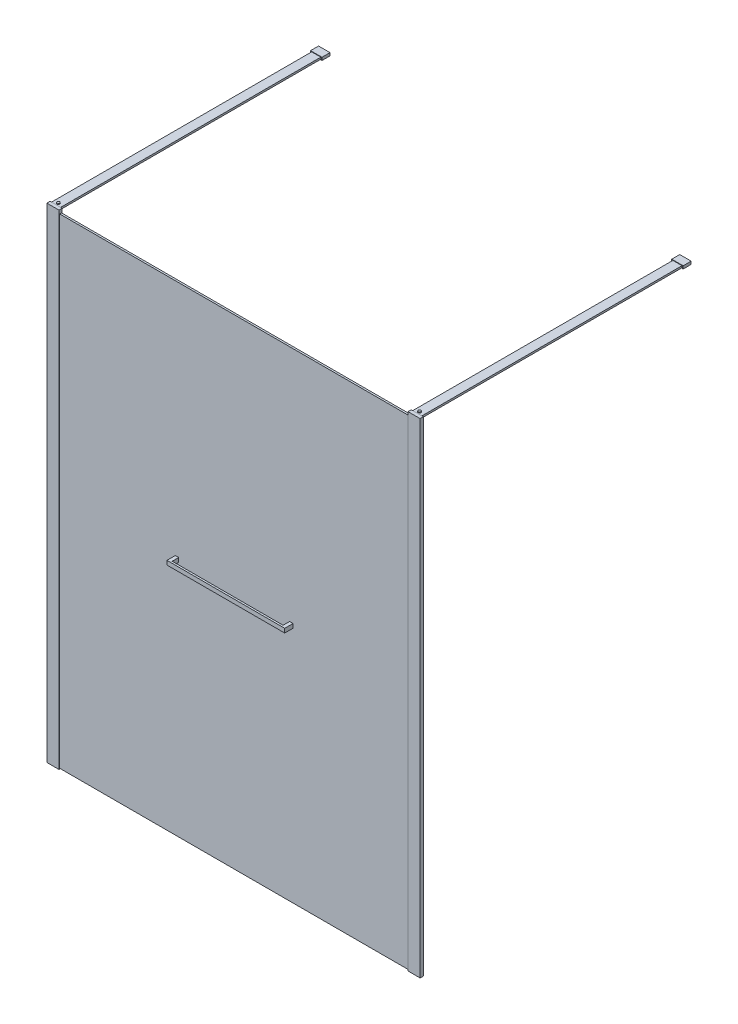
ISO-10303-21;
HEADER;
FILE_DESCRIPTION(('STEP AP214'),'2;1');
FILE_NAME('part.step','',(''),(''),'','','');
FILE_SCHEMA(('AUTOMOTIVE_DESIGN { 1 0 10303 214 1 1 1 1 }'));
ENDSEC;
DATA;
#1=APPLICATION_CONTEXT('core data for automotive mechanical design processes');
#2=APPLICATION_PROTOCOL_DEFINITION('international standard','automotive_design',2000,#1);
#3=PRODUCT_CONTEXT('',#1,'mechanical');
#4=PRODUCT('Part','Part','',(#3));
#5=PRODUCT_RELATED_PRODUCT_CATEGORY('part','',(#4));
#6=PRODUCT_DEFINITION_FORMATION('','',#4);
#7=PRODUCT_DEFINITION_CONTEXT('part definition',#1,'design');
#8=PRODUCT_DEFINITION('design','',#6,#7);
#9=PRODUCT_DEFINITION_SHAPE('','',#8);
#10=(LENGTH_UNIT() NAMED_UNIT(*) SI_UNIT(.MILLI.,.METRE.));
#11=(NAMED_UNIT(*) PLANE_ANGLE_UNIT() SI_UNIT($,.RADIAN.));
#12=(NAMED_UNIT(*) SI_UNIT($,.STERADIAN.) SOLID_ANGLE_UNIT());
#13=UNCERTAINTY_MEASURE_WITH_UNIT(LENGTH_MEASURE(1.E-05),#10,'distance_accuracy_value','');
#14=(GEOMETRIC_REPRESENTATION_CONTEXT(3) GLOBAL_UNCERTAINTY_ASSIGNED_CONTEXT((#13)) GLOBAL_UNIT_ASSIGNED_CONTEXT((#10,
#11,#12)) REPRESENTATION_CONTEXT('',''));
#15=CARTESIAN_POINT('',(0.,0.,0.));
#16=DIRECTION('',(0.,0.,1.));
#17=DIRECTION('',(1.,0.,0.));
#18=AXIS2_PLACEMENT_3D('',#15,#16,#17);
#19=CARTESIAN_POINT('',(573.9,1062.,-21.));
#20=DIRECTION('',(1.,0.,0.));
#21=DIRECTION('',(0.,0.,-1.));
#22=AXIS2_PLACEMENT_3D('',#19,#20,#21);
#23=PLANE('',#22);
#24=DIRECTION('',(0.,1.,0.));
#25=VECTOR('',#24,1.);
#26=CARTESIAN_POINT('',(573.9,1062.,25.5));
#27=LINE('',#26,#25);
#28=CARTESIAN_POINT('',(573.9,1044.,25.5));
#29=VERTEX_POINT('',#28);
#30=CARTESIAN_POINT('',(573.9,1062.,25.5));
#31=VERTEX_POINT('',#30);
#32=EDGE_CURVE('E63',#29,#31,#27,.T.);
#33=ORIENTED_EDGE('',*,*,#32,.F.);
#34=DIRECTION('',(0.,0.,1.));
#35=VECTOR('',#34,1.);
#36=CARTESIAN_POINT('',(573.9,1044.,-21.));
#37=LINE('',#36,#35);
#38=CARTESIAN_POINT('',(573.9,1044.,-21.));
#39=VERTEX_POINT('',#38);
#40=EDGE_CURVE('E12',#39,#29,#37,.T.);
#41=ORIENTED_EDGE('',*,*,#40,.F.);
#42=DIRECTION('',(0.,1.,0.));
#43=VECTOR('',#42,1.);
#44=CARTESIAN_POINT('',(573.9,1062.,-21.));
#45=LINE('',#44,#43);
#46=CARTESIAN_POINT('',(573.9,1062.,-21.));
#47=VERTEX_POINT('',#46);
#48=EDGE_CURVE('E193',#39,#47,#45,.T.);
#49=ORIENTED_EDGE('',*,*,#48,.T.);
#50=DIRECTION('',(0.,0.,1.));
#51=VECTOR('',#50,1.);
#52=CARTESIAN_POINT('',(573.9,1062.,-21.));
#53=LINE('',#52,#51);
#54=EDGE_CURVE('E176',#47,#31,#53,.T.);
#55=ORIENTED_EDGE('',*,*,#54,.T.);
#56=EDGE_LOOP('',(#33,#41,#49,#55));
#57=FACE_BOUND('',#56,.T.);
#58=ADVANCED_FACE('F46',(#57),#23,.T.);
#59=CARTESIAN_POINT('',(558.9,1044.,-21.));
#60=DIRECTION('',(0.,-1.,0.));
#61=DIRECTION('',(0.,0.,-1.));
#62=AXIS2_PLACEMENT_3D('',#59,#60,#61);
#63=PLANE('',#62);
#64=ORIENTED_EDGE('',*,*,#40,.T.);
#65=DIRECTION('',(-1.,0.,0.));
#66=VECTOR('',#65,1.);
#67=CARTESIAN_POINT('',(1078.59771560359,1044.,25.5));
#68=LINE('',#67,#66);
#69=CARTESIAN_POINT('',(1058.9,1044.,25.5));
#70=VERTEX_POINT('',#69);
#71=EDGE_CURVE('E166',#70,#29,#68,.T.);
#72=ORIENTED_EDGE('',*,*,#71,.F.);
#73=DIRECTION('',(0.,0.,1.));
#74=VECTOR('',#73,1.);
#75=CARTESIAN_POINT('',(1058.9,1044.,-21.));
#76=LINE('',#75,#74);
#77=CARTESIAN_POINT('',(1058.9,1044.,-21.));
#78=VERTEX_POINT('',#77);
#79=EDGE_CURVE('E149',#78,#70,#76,.T.);
#80=ORIENTED_EDGE('',*,*,#79,.F.);
#81=DIRECTION('',(1.,0.,0.));
#82=VECTOR('',#81,1.);
#83=CARTESIAN_POINT('',(1058.9,1044.,-21.));
#84=LINE('',#83,#82);
#85=CARTESIAN_POINT('',(1073.9,1044.,-21.));
#86=VERTEX_POINT('',#85);
#87=EDGE_CURVE('E131',#78,#86,#84,.T.);
#88=ORIENTED_EDGE('',*,*,#87,.T.);
#89=DIRECTION('',(0.,0.,1.));
#90=VECTOR('',#89,1.);
#91=CARTESIAN_POINT('',(1073.9,1044.,-21.));
#92=LINE('',#91,#90);
#93=CARTESIAN_POINT('',(1073.9,1044.,33.5));
#94=VERTEX_POINT('',#93);
#95=EDGE_CURVE('E147',#86,#94,#92,.T.);
#96=ORIENTED_EDGE('',*,*,#95,.T.);
#97=DIRECTION('',(1.,0.,0.));
#98=VECTOR('',#97,1.);
#99=CARTESIAN_POINT('',(558.9,1044.,33.5));
#100=LINE('',#99,#98);
#101=CARTESIAN_POINT('',(558.9,1044.,33.5));
#102=VERTEX_POINT('',#101);
#103=EDGE_CURVE('E135',#102,#94,#100,.T.);
#104=ORIENTED_EDGE('',*,*,#103,.F.);
#105=DIRECTION('',(0.,0.,1.));
#106=VECTOR('',#105,1.);
#107=CARTESIAN_POINT('',(558.9,1044.,-21.));
#108=LINE('',#107,#106);
#109=CARTESIAN_POINT('',(558.9,1044.,-21.));
#110=VERTEX_POINT('',#109);
#111=EDGE_CURVE('E55',#110,#102,#108,.T.);
#112=ORIENTED_EDGE('',*,*,#111,.F.);
#113=DIRECTION('',(1.,0.,0.));
#114=VECTOR('',#113,1.);
#115=CARTESIAN_POINT('',(558.9,1044.,-21.));
#116=LINE('',#115,#114);
#117=EDGE_CURVE('E181',#110,#39,#116,.T.);
#118=ORIENTED_EDGE('',*,*,#117,.T.);
#119=EDGE_LOOP('',(#64,#72,#80,#88,#96,#104,#112,#118));
#120=FACE_BOUND('',#119,.T.);
#121=ADVANCED_FACE('F197',(#120),#63,.T.);
#122=CARTESIAN_POINT('',(558.9,1062.,-21.));
#123=DIRECTION('',(-1.,0.,0.));
#124=DIRECTION('',(0.,0.,1.));
#125=AXIS2_PLACEMENT_3D('',#122,#123,#124);
#126=PLANE('',#125);
#127=ORIENTED_EDGE('',*,*,#111,.T.);
#128=DIRECTION('',(0.,-1.,0.));
#129=VECTOR('',#128,1.);
#130=CARTESIAN_POINT('',(558.9,1062.,33.5));
#131=LINE('',#130,#129);
#132=CARTESIAN_POINT('',(558.9,1062.,33.5));
#133=VERTEX_POINT('',#132);
#134=EDGE_CURVE('E121',#133,#102,#131,.T.);
#135=ORIENTED_EDGE('',*,*,#134,.F.);
#136=DIRECTION('',(0.,0.,1.));
#137=VECTOR('',#136,1.);
#138=CARTESIAN_POINT('',(558.9,1062.,-21.));
#139=LINE('',#138,#137);
#140=CARTESIAN_POINT('',(558.9,1062.,-21.));
#141=VERTEX_POINT('',#140);
#142=EDGE_CURVE('E116',#141,#133,#139,.T.);
#143=ORIENTED_EDGE('',*,*,#142,.F.);
#144=DIRECTION('',(0.,-1.,0.));
#145=VECTOR('',#144,1.);
#146=CARTESIAN_POINT('',(558.9,1062.,-21.));
#147=LINE('',#146,#145);
#148=EDGE_CURVE('E186',#141,#110,#147,.T.);
#149=ORIENTED_EDGE('',*,*,#148,.T.);
#150=EDGE_LOOP('',(#127,#135,#143,#149));
#151=FACE_BOUND('',#150,.T.);
#152=ADVANCED_FACE('F218',(#151),#126,.T.);
#153=CARTESIAN_POINT('',(558.9,1062.,-21.));
#154=DIRECTION('',(0.,1.,0.));
#155=DIRECTION('',(0.,0.,1.));
#156=AXIS2_PLACEMENT_3D('',#153,#154,#155);
#157=PLANE('',#156);
#158=ORIENTED_EDGE('',*,*,#142,.T.);
#159=DIRECTION('',(-1.,0.,0.));
#160=VECTOR('',#159,1.);
#161=CARTESIAN_POINT('',(558.9,1062.,33.5));
#162=LINE('',#161,#160);
#163=CARTESIAN_POINT('',(1073.9,1062.,33.5));
#164=VERTEX_POINT('',#163);
#165=EDGE_CURVE('E109',#164,#133,#162,.T.);
#166=ORIENTED_EDGE('',*,*,#165,.F.);
#167=DIRECTION('',(0.,0.,1.));
#168=VECTOR('',#167,1.);
#169=CARTESIAN_POINT('',(1073.9,1062.,-21.));
#170=LINE('',#169,#168);
#171=CARTESIAN_POINT('',(1073.9,1062.,-21.));
#172=VERTEX_POINT('',#171);
#173=EDGE_CURVE('E113',#172,#164,#170,.T.);
#174=ORIENTED_EDGE('',*,*,#173,.F.);
#175=DIRECTION('',(-1.,0.,0.));
#176=VECTOR('',#175,1.);
#177=CARTESIAN_POINT('',(1058.9,1062.,-21.));
#178=LINE('',#177,#176);
#179=CARTESIAN_POINT('',(1058.9,1062.,-21.));
#180=VERTEX_POINT('',#179);
#181=EDGE_CURVE('E138',#172,#180,#178,.T.);
#182=ORIENTED_EDGE('',*,*,#181,.T.);
#183=DIRECTION('',(0.,0.,1.));
#184=VECTOR('',#183,1.);
#185=CARTESIAN_POINT('',(1058.9,1062.,-21.));
#186=LINE('',#185,#184);
#187=CARTESIAN_POINT('',(1058.9,1062.,25.5));
#188=VERTEX_POINT('',#187);
#189=EDGE_CURVE('E130',#180,#188,#186,.T.);
#190=ORIENTED_EDGE('',*,*,#189,.T.);
#191=DIRECTION('',(-1.,0.,0.));
#192=VECTOR('',#191,1.);
#193=CARTESIAN_POINT('',(1078.59771560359,1062.,25.5));
#194=LINE('',#193,#192);
#195=EDGE_CURVE('E163',#188,#31,#194,.T.);
#196=ORIENTED_EDGE('',*,*,#195,.T.);
#197=ORIENTED_EDGE('',*,*,#54,.F.);
#198=DIRECTION('',(-1.,0.,0.));
#199=VECTOR('',#198,1.);
#200=CARTESIAN_POINT('',(558.9,1062.,-21.));
#201=LINE('',#200,#199);
#202=EDGE_CURVE('E190',#47,#141,#201,.T.);
#203=ORIENTED_EDGE('',*,*,#202,.T.);
#204=EDGE_LOOP('',(#158,#166,#174,#182,#190,#196,#197,#203));
#205=FACE_BOUND('',#204,.T.);
#206=ADVANCED_FACE('F111',(#205),#157,.T.);
#207=CARTESIAN_POINT('',(573.9,1044.,-21.));
#208=DIRECTION('',(0.,0.,1.));
#209=DIRECTION('',(1.,0.,0.));
#210=AXIS2_PLACEMENT_3D('',#207,#208,#209);
#211=PLANE('',#210);
#212=ORIENTED_EDGE('',*,*,#48,.F.);
#213=ORIENTED_EDGE('',*,*,#117,.F.);
#214=ORIENTED_EDGE('',*,*,#148,.F.);
#215=ORIENTED_EDGE('',*,*,#202,.F.);
#216=EDGE_LOOP('',(#212,#213,#214,#215));
#217=FACE_BOUND('',#216,.T.);
#218=ADVANCED_FACE('F225',(#217),#211,.F.);
#219=CARTESIAN_POINT('',(573.9,1044.,33.5));
#220=DIRECTION('',(0.,0.,1.));
#221=DIRECTION('',(1.,0.,0.));
#222=AXIS2_PLACEMENT_3D('',#219,#220,#221);
#223=PLANE('',#222);
#224=ORIENTED_EDGE('',*,*,#103,.T.);
#225=DIRECTION('',(0.,1.,0.));
#226=VECTOR('',#225,1.);
#227=CARTESIAN_POINT('',(1073.9,1062.,33.5));
#228=LINE('',#227,#226);
#229=EDGE_CURVE('E127',#94,#164,#228,.T.);
#230=ORIENTED_EDGE('',*,*,#229,.T.);
#231=ORIENTED_EDGE('',*,*,#165,.T.);
#232=ORIENTED_EDGE('',*,*,#134,.T.);
#233=EDGE_LOOP('',(#224,#230,#231,#232));
#234=FACE_BOUND('',#233,.T.);
#235=ADVANCED_FACE('F133',(#234),#223,.T.);
#236=CARTESIAN_POINT('',(1078.59771560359,1062.,25.5));
#237=DIRECTION('',(0.,0.,1.));
#238=DIRECTION('',(1.,0.,0.));
#239=AXIS2_PLACEMENT_3D('',#236,#237,#238);
#240=PLANE('',#239);
#241=ORIENTED_EDGE('',*,*,#195,.F.);
#242=DIRECTION('',(0.,-1.,0.));
#243=VECTOR('',#242,1.);
#244=CARTESIAN_POINT('',(1058.9,1062.,25.5));
#245=LINE('',#244,#243);
#246=EDGE_CURVE('E49',#188,#70,#245,.T.);
#247=ORIENTED_EDGE('',*,*,#246,.T.);
#248=ORIENTED_EDGE('',*,*,#71,.T.);
#249=ORIENTED_EDGE('',*,*,#32,.T.);
#250=EDGE_LOOP('',(#241,#247,#248,#249));
#251=FACE_BOUND('',#250,.T.);
#252=ADVANCED_FACE('F203',(#251),#240,.F.);
#253=CARTESIAN_POINT('',(1058.9,1062.,-21.));
#254=DIRECTION('',(-1.,0.,0.));
#255=DIRECTION('',(0.,0.,1.));
#256=AXIS2_PLACEMENT_3D('',#253,#254,#255);
#257=PLANE('',#256);
#258=ORIENTED_EDGE('',*,*,#246,.F.);
#259=ORIENTED_EDGE('',*,*,#189,.F.);
#260=DIRECTION('',(0.,-1.,0.));
#261=VECTOR('',#260,1.);
#262=CARTESIAN_POINT('',(1058.9,1062.,-21.));
#263=LINE('',#262,#261);
#264=EDGE_CURVE('E142',#180,#78,#263,.T.);
#265=ORIENTED_EDGE('',*,*,#264,.T.);
#266=ORIENTED_EDGE('',*,*,#79,.T.);
#267=EDGE_LOOP('',(#258,#259,#265,#266));
#268=FACE_BOUND('',#267,.T.);
#269=ADVANCED_FACE('F204',(#268),#257,.T.);
#270=CARTESIAN_POINT('',(1073.9,1062.,-21.));
#271=DIRECTION('',(1.,0.,0.));
#272=DIRECTION('',(0.,0.,-1.));
#273=AXIS2_PLACEMENT_3D('',#270,#271,#272);
#274=PLANE('',#273);
#275=ORIENTED_EDGE('',*,*,#173,.T.);
#276=ORIENTED_EDGE('',*,*,#229,.F.);
#277=ORIENTED_EDGE('',*,*,#95,.F.);
#278=DIRECTION('',(0.,1.,0.));
#279=VECTOR('',#278,1.);
#280=CARTESIAN_POINT('',(1073.9,1062.,-21.));
#281=LINE('',#280,#279);
#282=EDGE_CURVE('E129',#86,#172,#281,.T.);
#283=ORIENTED_EDGE('',*,*,#282,.T.);
#284=EDGE_LOOP('',(#275,#276,#277,#283));
#285=FACE_BOUND('',#284,.T.);
#286=ADVANCED_FACE('F126',(#285),#274,.T.);
#287=CARTESIAN_POINT('',(1073.9,1044.,-21.));
#288=DIRECTION('',(0.,0.,1.));
#289=DIRECTION('',(1.,0.,0.));
#290=AXIS2_PLACEMENT_3D('',#287,#288,#289);
#291=PLANE('',#290);
#292=ORIENTED_EDGE('',*,*,#282,.F.);
#293=ORIENTED_EDGE('',*,*,#87,.F.);
#294=ORIENTED_EDGE('',*,*,#264,.F.);
#295=ORIENTED_EDGE('',*,*,#181,.F.);
#296=EDGE_LOOP('',(#292,#293,#294,#295));
#297=FACE_BOUND('',#296,.T.);
#298=ADVANCED_FACE('F200',(#297),#291,.F.);
#299=CLOSED_SHELL('',(#58,#121,#152,#206,#218,#235,#252,#269,#286,#298));
#300=MANIFOLD_SOLID_BREP('B2',#299);
#301=CARTESIAN_POINT('',(46.5000000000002,2119.,-1184.));
#302=DIRECTION('',(-1.,0.,0.));
#303=DIRECTION('',(0.,0.,1.));
#304=AXIS2_PLACEMENT_3D('',#301,#302,#303);
#305=PLANE('',#304);
#306=DIRECTION('',(0.,-1.,0.));
#307=VECTOR('',#306,1.);
#308=CARTESIAN_POINT('',(46.5000000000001,2119.,-1152.));
#309=LINE('',#308,#307);
#310=CARTESIAN_POINT('',(46.5000000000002,2119.,-1152.));
#311=VERTEX_POINT('',#310);
#312=CARTESIAN_POINT('',(46.5000000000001,2111.,-1152.));
#313=VERTEX_POINT('',#312);
#314=EDGE_CURVE('E417',#311,#313,#309,.T.);
#315=ORIENTED_EDGE('',*,*,#314,.F.);
#316=DIRECTION('',(0.,0.,1.));
#317=VECTOR('',#316,1.);
#318=CARTESIAN_POINT('',(46.5000000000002,2119.,-1184.));
#319=LINE('',#318,#317);
#320=CARTESIAN_POINT('',(46.5,2119.,-14.));
#321=VERTEX_POINT('',#320);
#322=EDGE_CURVE('E432',#311,#321,#319,.T.);
#323=ORIENTED_EDGE('',*,*,#322,.T.);
#324=DIRECTION('',(0.,-1.,0.));
#325=VECTOR('',#324,1.);
#326=CARTESIAN_POINT('',(46.5,2119.,-14.));
#327=LINE('',#326,#325);
#328=CARTESIAN_POINT('',(46.5,2111.,-14.));
#329=VERTEX_POINT('',#328);
#330=EDGE_CURVE('E420',#321,#329,#327,.T.);
#331=ORIENTED_EDGE('',*,*,#330,.T.);
#332=DIRECTION('',(0.,0.,1.));
#333=VECTOR('',#332,1.);
#334=CARTESIAN_POINT('',(46.5000000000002,2111.,-1184.));
#335=LINE('',#334,#333);
#336=EDGE_CURVE('E327',#313,#329,#335,.T.);
#337=ORIENTED_EDGE('',*,*,#336,.F.);
#338=EDGE_LOOP('',(#315,#323,#331,#337));
#339=FACE_BOUND('',#338,.T.);
#340=ADVANCED_FACE('F319',(#339),#305,.F.);
#341=CARTESIAN_POINT('',(46.5000000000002,2111.,-1184.));
#342=DIRECTION('',(0.,1.,0.));
#343=DIRECTION('',(0.,0.,1.));
#344=AXIS2_PLACEMENT_3D('',#341,#342,#343);
#345=PLANE('',#344);
#346=DIRECTION('',(-1.,0.,0.));
#347=VECTOR('',#346,1.);
#348=CARTESIAN_POINT('',(46.5000000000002,2111.,-1152.));
#349=LINE('',#348,#347);
#350=CARTESIAN_POINT('',(6.50000000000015,2111.,-1152.));
#351=VERTEX_POINT('',#350);
#352=EDGE_CURVE('E334',#313,#351,#349,.T.);
#353=ORIENTED_EDGE('',*,*,#352,.F.);
#354=ORIENTED_EDGE('',*,*,#336,.T.);
#355=DIRECTION('',(-1.,0.,0.));
#356=VECTOR('',#355,1.);
#357=CARTESIAN_POINT('',(46.5,2111.,-14.));
#358=LINE('',#357,#356);
#359=CARTESIAN_POINT('',(6.5,2111.,-14.));
#360=VERTEX_POINT('',#359);
#361=EDGE_CURVE('E423',#329,#360,#358,.T.);
#362=ORIENTED_EDGE('',*,*,#361,.T.);
#363=DIRECTION('',(0.,0.,1.));
#364=VECTOR('',#363,1.);
#365=CARTESIAN_POINT('',(6.50000000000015,2111.,-1184.));
#366=LINE('',#365,#364);
#367=EDGE_CURVE('E436',#351,#360,#366,.T.);
#368=ORIENTED_EDGE('',*,*,#367,.F.);
#369=EDGE_LOOP('',(#353,#354,#362,#368));
#370=FACE_BOUND('',#369,.T.);
#371=ADVANCED_FACE('F438',(#370),#345,.F.);
#372=CARTESIAN_POINT('',(6.50000000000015,2119.,-1184.));
#373=DIRECTION('',(1.,0.,0.));
#374=DIRECTION('',(0.,0.,-1.));
#375=AXIS2_PLACEMENT_3D('',#372,#373,#374);
#376=PLANE('',#375);
#377=DIRECTION('',(0.,1.,0.));
#378=VECTOR('',#377,1.);
#379=CARTESIAN_POINT('',(6.50000000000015,2119.,-1152.));
#380=LINE('',#379,#378);
#381=CARTESIAN_POINT('',(6.50000000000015,2119.,-1152.));
#382=VERTEX_POINT('',#381);
#383=EDGE_CURVE('E342',#351,#382,#380,.T.);
#384=ORIENTED_EDGE('',*,*,#383,.F.);
#385=ORIENTED_EDGE('',*,*,#367,.T.);
#386=DIRECTION('',(0.,1.,0.));
#387=VECTOR('',#386,1.);
#388=CARTESIAN_POINT('',(6.5,2119.,-14.));
#389=LINE('',#388,#387);
#390=CARTESIAN_POINT('',(6.5,2119.,-14.));
#391=VERTEX_POINT('',#390);
#392=EDGE_CURVE('E426',#360,#391,#389,.T.);
#393=ORIENTED_EDGE('',*,*,#392,.T.);
#394=DIRECTION('',(0.,0.,1.));
#395=VECTOR('',#394,1.);
#396=CARTESIAN_POINT('',(6.50000000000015,2119.,-1184.));
#397=LINE('',#396,#395);
#398=EDGE_CURVE('E434',#382,#391,#397,.T.);
#399=ORIENTED_EDGE('',*,*,#398,.F.);
#400=EDGE_LOOP('',(#384,#385,#393,#399));
#401=FACE_BOUND('',#400,.T.);
#402=ADVANCED_FACE('F448',(#401),#376,.F.);
#403=CARTESIAN_POINT('',(46.5000000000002,2119.,-1184.));
#404=DIRECTION('',(0.,-1.,0.));
#405=DIRECTION('',(0.,0.,-1.));
#406=AXIS2_PLACEMENT_3D('',#403,#404,#405);
#407=PLANE('',#406);
#408=CARTESIAN_POINT('',(26.5,2119.,-24.));
#409=DIRECTION('',(0.,-1.,0.));
#410=DIRECTION('',(0.,0.,-1.));
#411=AXIS2_PLACEMENT_3D('',#408,#409,#410);
#412=CIRCLE('',#411,5.89999999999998);
#413=CARTESIAN_POINT('',(26.5,2119.,-29.9));
#414=VERTEX_POINT('',#413);
#415=EDGE_CURVE('E511',#414,#414,#412,.T.);
#416=ORIENTED_EDGE('',*,*,#415,.T.);
#417=EDGE_LOOP('',(#416));
#418=FACE_BOUND('',#417,.T.);
#419=DIRECTION('',(1.,0.,0.));
#420=VECTOR('',#419,1.);
#421=CARTESIAN_POINT('',(46.5000000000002,2119.,-1152.));
#422=LINE('',#421,#420);
#423=EDGE_CURVE('E44',#382,#311,#422,.T.);
#424=ORIENTED_EDGE('',*,*,#423,.F.);
#425=ORIENTED_EDGE('',*,*,#398,.T.);
#426=DIRECTION('',(1.,0.,0.));
#427=VECTOR('',#426,1.);
#428=CARTESIAN_POINT('',(46.5,2119.,-14.));
#429=LINE('',#428,#427);
#430=EDGE_CURVE('E429',#391,#321,#429,.T.);
#431=ORIENTED_EDGE('',*,*,#430,.T.);
#432=ORIENTED_EDGE('',*,*,#322,.F.);
#433=EDGE_LOOP('',(#424,#425,#431,#432));
#434=FACE_BOUND('',#433,.T.);
#435=ADVANCED_FACE('F447',(#418,#434),#407,.F.);
#436=CARTESIAN_POINT('',(46.5,2111.,-14.));
#437=DIRECTION('',(0.,0.,-1.));
#438=DIRECTION('',(-1.,0.,0.));
#439=AXIS2_PLACEMENT_3D('',#436,#437,#438);
#440=PLANE('',#439);
#441=ORIENTED_EDGE('',*,*,#330,.F.);
#442=ORIENTED_EDGE('',*,*,#430,.F.);
#443=ORIENTED_EDGE('',*,*,#392,.F.);
#444=ORIENTED_EDGE('',*,*,#361,.F.);
#445=EDGE_LOOP('',(#441,#442,#443,#444));
#446=FACE_BOUND('',#445,.T.);
#447=ADVANCED_FACE('F444',(#446),#440,.F.);
#448=CARTESIAN_POINT('',(1.50000000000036,2108.75,-1152.));
#449=DIRECTION('',(0.,0.,-1.));
#450=DIRECTION('',(-1.,0.,0.));
#451=AXIS2_PLACEMENT_3D('',#448,#449,#450);
#452=PLANE('',#451);
#453=DIRECTION('',(0.,1.,0.));
#454=VECTOR('',#453,1.);
#455=CARTESIAN_POINT('',(1.50000000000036,2121.25,-1152.));
#456=LINE('',#455,#454);
#457=CARTESIAN_POINT('',(1.50000000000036,2108.75,-1152.));
#458=VERTEX_POINT('',#457);
#459=CARTESIAN_POINT('',(1.50000000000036,2121.25,-1152.));
#460=VERTEX_POINT('',#459);
#461=EDGE_CURVE('E409',#458,#460,#456,.T.);
#462=ORIENTED_EDGE('',*,*,#461,.F.);
#463=DIRECTION('',(-1.,0.,0.));
#464=VECTOR('',#463,1.);
#465=CARTESIAN_POINT('',(51.5000000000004,2108.75,-1152.));
#466=LINE('',#465,#464);
#467=CARTESIAN_POINT('',(51.5000000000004,2108.75,-1152.));
#468=VERTEX_POINT('',#467);
#469=EDGE_CURVE('E405',#468,#458,#466,.T.);
#470=ORIENTED_EDGE('',*,*,#469,.F.);
#471=DIRECTION('',(0.,-1.,0.));
#472=VECTOR('',#471,1.);
#473=CARTESIAN_POINT('',(51.5000000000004,2121.25,-1152.));
#474=LINE('',#473,#472);
#475=CARTESIAN_POINT('',(51.5000000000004,2121.25,-1152.));
#476=VERTEX_POINT('',#475);
#477=EDGE_CURVE('E492',#476,#468,#474,.T.);
#478=ORIENTED_EDGE('',*,*,#477,.F.);
#479=DIRECTION('',(1.,0.,0.));
#480=VECTOR('',#479,1.);
#481=CARTESIAN_POINT('',(51.5000000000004,2121.25,-1152.));
#482=LINE('',#481,#480);
#483=EDGE_CURVE('E495',#460,#476,#482,.T.);
#484=ORIENTED_EDGE('',*,*,#483,.F.);
#485=EDGE_LOOP('',(#462,#470,#478,#484));
#486=FACE_BOUND('',#485,.T.);
#487=ORIENTED_EDGE('',*,*,#423,.T.);
#488=ORIENTED_EDGE('',*,*,#314,.T.);
#489=ORIENTED_EDGE('',*,*,#352,.T.);
#490=ORIENTED_EDGE('',*,*,#383,.T.);
#491=EDGE_LOOP('',(#487,#488,#489,#490));
#492=FACE_BOUND('',#491,.T.);
#493=ADVANCED_FACE('F450',(#486,#492),#452,.F.);
#494=CARTESIAN_POINT('',(1.50000000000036,2121.25,-1187.));
#495=DIRECTION('',(1.,0.,0.));
#496=DIRECTION('',(0.,0.,-1.));
#497=AXIS2_PLACEMENT_3D('',#494,#495,#496);
#498=PLANE('',#497);
#499=ORIENTED_EDGE('',*,*,#461,.T.);
#500=DIRECTION('',(0.,0.,1.));
#501=VECTOR('',#500,1.);
#502=CARTESIAN_POINT('',(1.50000000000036,2121.25,-1187.));
#503=LINE('',#502,#501);
#504=CARTESIAN_POINT('',(1.50000000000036,2121.25,-1187.));
#505=VERTEX_POINT('',#504);
#506=EDGE_CURVE('E389',#505,#460,#503,.T.);
#507=ORIENTED_EDGE('',*,*,#506,.F.);
#508=DIRECTION('',(0.,1.,0.));
#509=VECTOR('',#508,1.);
#510=CARTESIAN_POINT('',(1.50000000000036,2121.25,-1187.));
#511=LINE('',#510,#509);
#512=CARTESIAN_POINT('',(1.50000000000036,2108.75,-1187.));
#513=VERTEX_POINT('',#512);
#514=EDGE_CURVE('E396',#513,#505,#511,.T.);
#515=ORIENTED_EDGE('',*,*,#514,.F.);
#516=DIRECTION('',(0.,0.,1.));
#517=VECTOR('',#516,1.);
#518=CARTESIAN_POINT('',(1.50000000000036,2108.75,-1187.));
#519=LINE('',#518,#517);
#520=EDGE_CURVE('E489',#513,#458,#519,.T.);
#521=ORIENTED_EDGE('',*,*,#520,.T.);
#522=EDGE_LOOP('',(#499,#507,#515,#521));
#523=FACE_BOUND('',#522,.T.);
#524=ADVANCED_FACE('F407',(#523),#498,.F.);
#525=CARTESIAN_POINT('',(51.5000000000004,2121.25,-1187.));
#526=DIRECTION('',(0.,-1.,0.));
#527=DIRECTION('',(0.,0.,-1.));
#528=AXIS2_PLACEMENT_3D('',#525,#526,#527);
#529=PLANE('',#528);
#530=ORIENTED_EDGE('',*,*,#483,.T.);
#531=DIRECTION('',(0.,0.,1.));
#532=VECTOR('',#531,1.);
#533=CARTESIAN_POINT('',(51.5000000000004,2121.25,-1187.));
#534=LINE('',#533,#532);
#535=CARTESIAN_POINT('',(51.5000000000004,2121.25,-1187.));
#536=VERTEX_POINT('',#535);
#537=EDGE_CURVE('E392',#536,#476,#534,.T.);
#538=ORIENTED_EDGE('',*,*,#537,.F.);
#539=DIRECTION('',(1.,0.,0.));
#540=VECTOR('',#539,1.);
#541=CARTESIAN_POINT('',(51.5000000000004,2121.25,-1187.));
#542=LINE('',#541,#540);
#543=EDGE_CURVE('E385',#505,#536,#542,.T.);
#544=ORIENTED_EDGE('',*,*,#543,.F.);
#545=ORIENTED_EDGE('',*,*,#506,.T.);
#546=EDGE_LOOP('',(#530,#538,#544,#545));
#547=FACE_BOUND('',#546,.T.);
#548=ADVANCED_FACE('F387',(#547),#529,.F.);
#549=CARTESIAN_POINT('',(51.5000000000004,2121.25,-1187.));
#550=DIRECTION('',(-1.,0.,0.));
#551=DIRECTION('',(0.,0.,1.));
#552=AXIS2_PLACEMENT_3D('',#549,#550,#551);
#553=PLANE('',#552);
#554=ORIENTED_EDGE('',*,*,#477,.T.);
#555=DIRECTION('',(0.,0.,1.));
#556=VECTOR('',#555,1.);
#557=CARTESIAN_POINT('',(51.5000000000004,2108.75,-1187.));
#558=LINE('',#557,#556);
#559=CARTESIAN_POINT('',(51.5000000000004,2108.75,-1187.));
#560=VERTEX_POINT('',#559);
#561=EDGE_CURVE('E412',#560,#468,#558,.T.);
#562=ORIENTED_EDGE('',*,*,#561,.F.);
#563=DIRECTION('',(0.,-1.,0.));
#564=VECTOR('',#563,1.);
#565=CARTESIAN_POINT('',(51.5000000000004,2121.25,-1187.));
#566=LINE('',#565,#564);
#567=EDGE_CURVE('E395',#536,#560,#566,.T.);
#568=ORIENTED_EDGE('',*,*,#567,.F.);
#569=ORIENTED_EDGE('',*,*,#537,.T.);
#570=EDGE_LOOP('',(#554,#562,#568,#569));
#571=FACE_BOUND('',#570,.T.);
#572=ADVANCED_FACE('F477',(#571),#553,.F.);
#573=CARTESIAN_POINT('',(51.5000000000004,2108.75,-1187.));
#574=DIRECTION('',(0.,1.,0.));
#575=DIRECTION('',(0.,0.,1.));
#576=AXIS2_PLACEMENT_3D('',#573,#574,#575);
#577=PLANE('',#576);
#578=ORIENTED_EDGE('',*,*,#469,.T.);
#579=ORIENTED_EDGE('',*,*,#520,.F.);
#580=DIRECTION('',(-1.,0.,0.));
#581=VECTOR('',#580,1.);
#582=CARTESIAN_POINT('',(51.5000000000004,2108.75,-1187.));
#583=LINE('',#582,#581);
#584=EDGE_CURVE('E401',#560,#513,#583,.T.);
#585=ORIENTED_EDGE('',*,*,#584,.F.);
#586=ORIENTED_EDGE('',*,*,#561,.T.);
#587=EDGE_LOOP('',(#578,#579,#585,#586));
#588=FACE_BOUND('',#587,.T.);
#589=ADVANCED_FACE('F479',(#588),#577,.F.);
#590=CARTESIAN_POINT('',(1.50000000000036,2108.75,-1187.));
#591=DIRECTION('',(0.,0.,-1.));
#592=DIRECTION('',(-1.,0.,0.));
#593=AXIS2_PLACEMENT_3D('',#590,#591,#592);
#594=PLANE('',#593);
#595=ORIENTED_EDGE('',*,*,#514,.T.);
#596=ORIENTED_EDGE('',*,*,#543,.T.);
#597=ORIENTED_EDGE('',*,*,#567,.T.);
#598=ORIENTED_EDGE('',*,*,#584,.T.);
#599=EDGE_LOOP('',(#595,#596,#597,#598));
#600=FACE_BOUND('',#599,.T.);
#601=ADVANCED_FACE('F399',(#600),#594,.T.);
#602=CARTESIAN_POINT('',(26.5,2115.34934210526,-24.));
#603=DIRECTION('',(0.,-1.,0.));
#604=DIRECTION('',(0.,0.,-1.));
#605=AXIS2_PLACEMENT_3D('',#602,#603,#604);
#606=SPHERICAL_SURFACE('',#605,9.35065789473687);
#607=CARTESIAN_POINT('',(26.5,2122.8,-24.));
#608=DIRECTION('',(0.,-1.,0.));
#609=DIRECTION('',(0.,0.,-1.));
#610=AXIS2_PLACEMENT_3D('',#607,#608,#609);
#611=CIRCLE('',#610,5.64999999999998);
#612=CARTESIAN_POINT('',(26.5,2122.8,-29.65));
#613=VERTEX_POINT('',#612);
#614=EDGE_CURVE('E508',#613,#613,#611,.T.);
#615=ORIENTED_EDGE('',*,*,#614,.F.);
#616=EDGE_LOOP('',(#615));
#617=FACE_BOUND('',#616,.T.);
#618=ADVANCED_FACE('F486',(#617),#606,.T.);
#619=CARTESIAN_POINT('',(26.5,2119.,-24.));
#620=DIRECTION('',(0.,-1.,0.));
#621=DIRECTION('',(0.,0.,-1.));
#622=AXIS2_PLACEMENT_3D('',#619,#620,#621);
#623=CONICAL_SURFACE('',#622,5.89999999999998,0.0656948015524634);
#624=ORIENTED_EDGE('',*,*,#614,.T.);
#625=EDGE_LOOP('',(#624));
#626=FACE_BOUND('',#625,.T.);
#627=ORIENTED_EDGE('',*,*,#415,.F.);
#628=EDGE_LOOP('',(#627));
#629=FACE_BOUND('',#628,.T.);
#630=ADVANCED_FACE('F515',(#626,#629),#623,.T.);
#631=CLOSED_SHELL('',(#340,#371,#402,#435,#447,#493,#524,#548,#572,#589,#601,#618,#630));
#632=CARTESIAN_POINT('',(26.5,2122.53567623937,-24.));
#633=DIRECTION('',(0.,-1.,0.));
#634=DIRECTION('',(0.,0.,-1.));
#635=AXIS2_PLACEMENT_3D('',#632,#633,#634);
#636=CONICAL_SURFACE('',#635,5.16630882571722,0.065694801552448);
#637=CARTESIAN_POINT('',(26.5,2119.,-24.));
#638=DIRECTION('',(0.,-1.,0.));
#639=DIRECTION('',(0.,0.,-1.));
#640=AXIS2_PLACEMENT_3D('',#637,#638,#639);
#641=CIRCLE('',#640,5.39891910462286);
#642=CARTESIAN_POINT('',(26.5,2119.,-29.3989191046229));
#643=VERTEX_POINT('',#642);
#644=EDGE_CURVE('E496',#643,#643,#641,.T.);
#645=ORIENTED_EDGE('',*,*,#644,.T.);
#646=EDGE_LOOP('',(#645));
#647=FACE_BOUND('',#646,.T.);
#648=CARTESIAN_POINT('',(26.5,2122.53567623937,-24.));
#649=DIRECTION('',(0.,-1.,0.));
#650=DIRECTION('',(0.,0.,-1.));
#651=AXIS2_PLACEMENT_3D('',#648,#649,#650);
#652=CIRCLE('',#651,5.16630882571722);
#653=CARTESIAN_POINT('',(26.5,2122.53567623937,-29.1663088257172));
#654=VERTEX_POINT('',#653);
#655=EDGE_CURVE('E500',#654,#654,#652,.T.);
#656=ORIENTED_EDGE('',*,*,#655,.F.);
#657=EDGE_LOOP('',(#656));
#658=FACE_BOUND('',#657,.T.);
#659=ADVANCED_FACE('F529',(#647,#658),#636,.F.);
#660=CARTESIAN_POINT('',(26.5,2115.34934210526,-24.));
#661=DIRECTION('',(0.,-1.,0.));
#662=DIRECTION('',(0.,0.,-1.));
#663=AXIS2_PLACEMENT_3D('',#660,#661,#662);
#664=SPHERICAL_SURFACE('',#663,8.85065789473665);
#665=ORIENTED_EDGE('',*,*,#655,.T.);
#666=EDGE_LOOP('',(#665));
#667=FACE_BOUND('',#666,.T.);
#668=ADVANCED_FACE('F526',(#667),#664,.F.);
#669=ORIENTED_EDGE('',*,*,#644,.F.);
#670=EDGE_LOOP('',(#669));
#671=FACE_BOUND('',#670,.T.);
#672=ADVANCED_FACE('F473',(#671),#407,.F.);
#673=CLOSED_SHELL('',(#659,#668,#672));
#674=ORIENTED_CLOSED_SHELL('',*,#673,.T.);
#675=BREP_WITH_VOIDS('B6',#631,(#674));
#676=CARTESIAN_POINT('',(1626.3,2119.,-1184.));
#677=DIRECTION('',(0.,-1.,0.));
#678=DIRECTION('',(0.,0.,-1.));
#679=AXIS2_PLACEMENT_3D('',#676,#677,#678);
#680=PLANE('',#679);
#681=CARTESIAN_POINT('',(1606.3,2119.,-23.9999999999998));
#682=DIRECTION('',(0.,-1.,0.));
#683=DIRECTION('',(0.,0.,-1.));
#684=AXIS2_PLACEMENT_3D('',#681,#682,#683);
#685=CIRCLE('',#684,5.89999999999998);
#686=CARTESIAN_POINT('',(1606.3,2119.,-29.8999999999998));
#687=VERTEX_POINT('',#686);
#688=EDGE_CURVE('E814',#687,#687,#685,.T.);
#689=ORIENTED_EDGE('',*,*,#688,.T.);
#690=EDGE_LOOP('',(#689));
#691=FACE_BOUND('',#690,.T.);
#692=DIRECTION('',(1.,0.,0.));
#693=VECTOR('',#692,1.);
#694=CARTESIAN_POINT('',(1626.3,2119.,-1152.));
#695=LINE('',#694,#693);
#696=CARTESIAN_POINT('',(1586.3,2119.,-1152.));
#697=VERTEX_POINT('',#696);
#698=CARTESIAN_POINT('',(1626.3,2119.,-1152.));
#699=VERTEX_POINT('',#698);
#700=EDGE_CURVE('E316',#697,#699,#695,.T.);
#701=ORIENTED_EDGE('',*,*,#700,.F.);
#702=DIRECTION('',(0.,0.,1.));
#703=VECTOR('',#702,1.);
#704=CARTESIAN_POINT('',(1586.3,2119.,-1184.));
#705=LINE('',#704,#703);
#706=CARTESIAN_POINT('',(1586.3,2119.,-13.9999999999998));
#707=VERTEX_POINT('',#706);
#708=EDGE_CURVE('E755',#697,#707,#705,.T.);
#709=ORIENTED_EDGE('',*,*,#708,.T.);
#710=DIRECTION('',(1.,0.,0.));
#711=VECTOR('',#710,1.);
#712=CARTESIAN_POINT('',(1626.3,2119.,-13.9999999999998));
#713=LINE('',#712,#711);
#714=CARTESIAN_POINT('',(1626.3,2119.,-13.9999999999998));
#715=VERTEX_POINT('',#714);
#716=EDGE_CURVE('E750',#707,#715,#713,.T.);
#717=ORIENTED_EDGE('',*,*,#716,.T.);
#718=DIRECTION('',(0.,0.,1.));
#719=VECTOR('',#718,1.);
#720=CARTESIAN_POINT('',(1626.3,2119.,-1184.));
#721=LINE('',#720,#719);
#722=EDGE_CURVE('E753',#699,#715,#721,.T.);
#723=ORIENTED_EDGE('',*,*,#722,.F.);
#724=EDGE_LOOP('',(#701,#709,#717,#723));
#725=FACE_BOUND('',#724,.T.);
#726=ADVANCED_FACE('F639',(#691,#725),#680,.F.);
#727=CARTESIAN_POINT('',(1626.3,2119.,-1184.));
#728=DIRECTION('',(-1.,0.,0.));
#729=DIRECTION('',(0.,0.,1.));
#730=AXIS2_PLACEMENT_3D('',#727,#728,#729);
#731=PLANE('',#730);
#732=DIRECTION('',(0.,-1.,0.));
#733=VECTOR('',#732,1.);
#734=CARTESIAN_POINT('',(1626.3,2119.,-1152.));
#735=LINE('',#734,#733);
#736=CARTESIAN_POINT('',(1626.3,2111.,-1152.));
#737=VERTEX_POINT('',#736);
#738=EDGE_CURVE('E738',#699,#737,#735,.T.);
#739=ORIENTED_EDGE('',*,*,#738,.F.);
#740=ORIENTED_EDGE('',*,*,#722,.T.);
#741=DIRECTION('',(0.,-1.,0.));
#742=VECTOR('',#741,1.);
#743=CARTESIAN_POINT('',(1626.3,2119.,-13.9999999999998));
#744=LINE('',#743,#742);
#745=CARTESIAN_POINT('',(1626.3,2111.,-13.9999999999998));
#746=VERTEX_POINT('',#745);
#747=EDGE_CURVE('E741',#715,#746,#744,.T.);
#748=ORIENTED_EDGE('',*,*,#747,.T.);
#749=DIRECTION('',(0.,0.,1.));
#750=VECTOR('',#749,1.);
#751=CARTESIAN_POINT('',(1626.3,2111.,-1184.));
#752=LINE('',#751,#750);
#753=EDGE_CURVE('E648',#737,#746,#752,.T.);
#754=ORIENTED_EDGE('',*,*,#753,.F.);
#755=EDGE_LOOP('',(#739,#740,#748,#754));
#756=FACE_BOUND('',#755,.T.);
#757=ADVANCED_FACE('F641',(#756),#731,.F.);
#758=CARTESIAN_POINT('',(1626.3,2111.,-1184.));
#759=DIRECTION('',(0.,1.,0.));
#760=DIRECTION('',(0.,0.,1.));
#761=AXIS2_PLACEMENT_3D('',#758,#759,#760);
#762=PLANE('',#761);
#763=DIRECTION('',(-1.,0.,0.));
#764=VECTOR('',#763,1.);
#765=CARTESIAN_POINT('',(1626.3,2111.,-1152.));
#766=LINE('',#765,#764);
#767=CARTESIAN_POINT('',(1586.3,2111.,-1152.));
#768=VERTEX_POINT('',#767);
#769=EDGE_CURVE('E655',#737,#768,#766,.T.);
#770=ORIENTED_EDGE('',*,*,#769,.F.);
#771=ORIENTED_EDGE('',*,*,#753,.T.);
#772=DIRECTION('',(-1.,0.,0.));
#773=VECTOR('',#772,1.);
#774=CARTESIAN_POINT('',(1626.3,2111.,-13.9999999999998));
#775=LINE('',#774,#773);
#776=CARTESIAN_POINT('',(1586.3,2111.,-13.9999999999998));
#777=VERTEX_POINT('',#776);
#778=EDGE_CURVE('E744',#746,#777,#775,.T.);
#779=ORIENTED_EDGE('',*,*,#778,.T.);
#780=DIRECTION('',(0.,0.,1.));
#781=VECTOR('',#780,1.);
#782=CARTESIAN_POINT('',(1586.3,2111.,-1184.));
#783=LINE('',#782,#781);
#784=EDGE_CURVE('E757',#768,#777,#783,.T.);
#785=ORIENTED_EDGE('',*,*,#784,.F.);
#786=EDGE_LOOP('',(#770,#771,#779,#785));
#787=FACE_BOUND('',#786,.T.);
#788=ADVANCED_FACE('F759',(#787),#762,.F.);
#789=CARTESIAN_POINT('',(1586.3,2119.,-1184.));
#790=DIRECTION('',(1.,0.,0.));
#791=DIRECTION('',(0.,0.,-1.));
#792=AXIS2_PLACEMENT_3D('',#789,#790,#791);
#793=PLANE('',#792);
#794=DIRECTION('',(0.,1.,0.));
#795=VECTOR('',#794,1.);
#796=CARTESIAN_POINT('',(1586.3,2119.,-1152.));
#797=LINE('',#796,#795);
#798=EDGE_CURVE('E663',#768,#697,#797,.T.);
#799=ORIENTED_EDGE('',*,*,#798,.F.);
#800=ORIENTED_EDGE('',*,*,#784,.T.);
#801=DIRECTION('',(0.,1.,0.));
#802=VECTOR('',#801,1.);
#803=CARTESIAN_POINT('',(1586.3,2119.,-13.9999999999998));
#804=LINE('',#803,#802);
#805=EDGE_CURVE('E747',#777,#707,#804,.T.);
#806=ORIENTED_EDGE('',*,*,#805,.T.);
#807=ORIENTED_EDGE('',*,*,#708,.F.);
#808=EDGE_LOOP('',(#799,#800,#806,#807));
#809=FACE_BOUND('',#808,.T.);
#810=ADVANCED_FACE('F768',(#809),#793,.F.);
#811=CARTESIAN_POINT('',(1626.3,2111.,-13.9999999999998));
#812=DIRECTION('',(0.,0.,-1.));
#813=DIRECTION('',(-1.,0.,0.));
#814=AXIS2_PLACEMENT_3D('',#811,#812,#813);
#815=PLANE('',#814);
#816=ORIENTED_EDGE('',*,*,#747,.F.);
#817=ORIENTED_EDGE('',*,*,#716,.F.);
#818=ORIENTED_EDGE('',*,*,#805,.F.);
#819=ORIENTED_EDGE('',*,*,#778,.F.);
#820=EDGE_LOOP('',(#816,#817,#818,#819));
#821=FACE_BOUND('',#820,.T.);
#822=ADVANCED_FACE('F765',(#821),#815,.F.);
#823=CARTESIAN_POINT('',(1581.3,2108.75,-1152.));
#824=DIRECTION('',(0.,0.,-1.));
#825=DIRECTION('',(-1.,0.,0.));
#826=AXIS2_PLACEMENT_3D('',#823,#824,#825);
#827=PLANE('',#826);
#828=DIRECTION('',(0.,1.,0.));
#829=VECTOR('',#828,1.);
#830=CARTESIAN_POINT('',(1581.3,2121.25,-1152.));
#831=LINE('',#830,#829);
#832=CARTESIAN_POINT('',(1581.3,2108.75,-1152.));
#833=VERTEX_POINT('',#832);
#834=CARTESIAN_POINT('',(1581.3,2121.25,-1152.));
#835=VERTEX_POINT('',#834);
#836=EDGE_CURVE('E730',#833,#835,#831,.T.);
#837=ORIENTED_EDGE('',*,*,#836,.F.);
#838=DIRECTION('',(-1.,0.,0.));
#839=VECTOR('',#838,1.);
#840=CARTESIAN_POINT('',(1631.3,2108.75,-1152.));
#841=LINE('',#840,#839);
#842=CARTESIAN_POINT('',(1631.3,2108.75,-1152.));
#843=VERTEX_POINT('',#842);
#844=EDGE_CURVE('E726',#843,#833,#841,.T.);
#845=ORIENTED_EDGE('',*,*,#844,.F.);
#846=DIRECTION('',(0.,-1.,0.));
#847=VECTOR('',#846,1.);
#848=CARTESIAN_POINT('',(1631.3,2121.25,-1152.));
#849=LINE('',#848,#847);
#850=CARTESIAN_POINT('',(1631.3,2121.25,-1152.));
#851=VERTEX_POINT('',#850);
#852=EDGE_CURVE('E822',#851,#843,#849,.T.);
#853=ORIENTED_EDGE('',*,*,#852,.F.);
#854=DIRECTION('',(1.,0.,0.));
#855=VECTOR('',#854,1.);
#856=CARTESIAN_POINT('',(1631.3,2121.25,-1152.));
#857=LINE('',#856,#855);
#858=EDGE_CURVE('E820',#835,#851,#857,.T.);
#859=ORIENTED_EDGE('',*,*,#858,.F.);
#860=EDGE_LOOP('',(#837,#845,#853,#859));
#861=FACE_BOUND('',#860,.T.);
#862=ORIENTED_EDGE('',*,*,#700,.T.);
#863=ORIENTED_EDGE('',*,*,#738,.T.);
#864=ORIENTED_EDGE('',*,*,#769,.T.);
#865=ORIENTED_EDGE('',*,*,#798,.T.);
#866=EDGE_LOOP('',(#862,#863,#864,#865));
#867=FACE_BOUND('',#866,.T.);
#868=ADVANCED_FACE('F770',(#861,#867),#827,.F.);
#869=CARTESIAN_POINT('',(1581.3,2121.25,-1187.));
#870=DIRECTION('',(1.,0.,0.));
#871=DIRECTION('',(0.,0.,-1.));
#872=AXIS2_PLACEMENT_3D('',#869,#870,#871);
#873=PLANE('',#872);
#874=ORIENTED_EDGE('',*,*,#836,.T.);
#875=DIRECTION('',(0.,0.,1.));
#876=VECTOR('',#875,1.);
#877=CARTESIAN_POINT('',(1581.3,2121.25,-1187.));
#878=LINE('',#877,#876);
#879=CARTESIAN_POINT('',(1581.3,2121.25,-1187.));
#880=VERTEX_POINT('',#879);
#881=EDGE_CURVE('E710',#880,#835,#878,.T.);
#882=ORIENTED_EDGE('',*,*,#881,.F.);
#883=DIRECTION('',(0.,1.,0.));
#884=VECTOR('',#883,1.);
#885=CARTESIAN_POINT('',(1581.3,2121.25,-1187.));
#886=LINE('',#885,#884);
#887=CARTESIAN_POINT('',(1581.3,2108.75,-1187.));
#888=VERTEX_POINT('',#887);
#889=EDGE_CURVE('E717',#888,#880,#886,.T.);
#890=ORIENTED_EDGE('',*,*,#889,.F.);
#891=DIRECTION('',(0.,0.,1.));
#892=VECTOR('',#891,1.);
#893=CARTESIAN_POINT('',(1581.3,2108.75,-1187.));
#894=LINE('',#893,#892);
#895=EDGE_CURVE('E818',#888,#833,#894,.T.);
#896=ORIENTED_EDGE('',*,*,#895,.T.);
#897=EDGE_LOOP('',(#874,#882,#890,#896));
#898=FACE_BOUND('',#897,.T.);
#899=ADVANCED_FACE('F728',(#898),#873,.F.);
#900=CARTESIAN_POINT('',(1631.3,2121.25,-1187.));
#901=DIRECTION('',(0.,-1.,0.));
#902=DIRECTION('',(0.,0.,-1.));
#903=AXIS2_PLACEMENT_3D('',#900,#901,#902);
#904=PLANE('',#903);
#905=ORIENTED_EDGE('',*,*,#858,.T.);
#906=DIRECTION('',(0.,0.,1.));
#907=VECTOR('',#906,1.);
#908=CARTESIAN_POINT('',(1631.3,2121.25,-1187.));
#909=LINE('',#908,#907);
#910=CARTESIAN_POINT('',(1631.3,2121.25,-1187.));
#911=VERTEX_POINT('',#910);
#912=EDGE_CURVE('E713',#911,#851,#909,.T.);
#913=ORIENTED_EDGE('',*,*,#912,.F.);
#914=DIRECTION('',(1.,0.,0.));
#915=VECTOR('',#914,1.);
#916=CARTESIAN_POINT('',(1631.3,2121.25,-1187.));
#917=LINE('',#916,#915);
#918=EDGE_CURVE('E706',#880,#911,#917,.T.);
#919=ORIENTED_EDGE('',*,*,#918,.F.);
#920=ORIENTED_EDGE('',*,*,#881,.T.);
#921=EDGE_LOOP('',(#905,#913,#919,#920));
#922=FACE_BOUND('',#921,.T.);
#923=ADVANCED_FACE('F708',(#922),#904,.F.);
#924=CARTESIAN_POINT('',(1631.3,2121.25,-1187.));
#925=DIRECTION('',(-1.,0.,0.));
#926=DIRECTION('',(0.,0.,1.));
#927=AXIS2_PLACEMENT_3D('',#924,#925,#926);
#928=PLANE('',#927);
#929=ORIENTED_EDGE('',*,*,#852,.T.);
#930=DIRECTION('',(0.,0.,1.));
#931=VECTOR('',#930,1.);
#932=CARTESIAN_POINT('',(1631.3,2108.75,-1187.));
#933=LINE('',#932,#931);
#934=CARTESIAN_POINT('',(1631.3,2108.75,-1187.));
#935=VERTEX_POINT('',#934);
#936=EDGE_CURVE('E733',#935,#843,#933,.T.);
#937=ORIENTED_EDGE('',*,*,#936,.F.);
#938=DIRECTION('',(0.,-1.,0.));
#939=VECTOR('',#938,1.);
#940=CARTESIAN_POINT('',(1631.3,2121.25,-1187.));
#941=LINE('',#940,#939);
#942=EDGE_CURVE('E716',#911,#935,#941,.T.);
#943=ORIENTED_EDGE('',*,*,#942,.F.);
#944=ORIENTED_EDGE('',*,*,#912,.T.);
#945=EDGE_LOOP('',(#929,#937,#943,#944));
#946=FACE_BOUND('',#945,.T.);
#947=ADVANCED_FACE('F832',(#946),#928,.F.);
#948=CARTESIAN_POINT('',(1631.3,2108.75,-1187.));
#949=DIRECTION('',(0.,1.,0.));
#950=DIRECTION('',(0.,0.,1.));
#951=AXIS2_PLACEMENT_3D('',#948,#949,#950);
#952=PLANE('',#951);
#953=ORIENTED_EDGE('',*,*,#844,.T.);
#954=ORIENTED_EDGE('',*,*,#895,.F.);
#955=DIRECTION('',(-1.,0.,0.));
#956=VECTOR('',#955,1.);
#957=CARTESIAN_POINT('',(1631.3,2108.75,-1187.));
#958=LINE('',#957,#956);
#959=EDGE_CURVE('E722',#935,#888,#958,.T.);
#960=ORIENTED_EDGE('',*,*,#959,.F.);
#961=ORIENTED_EDGE('',*,*,#936,.T.);
#962=EDGE_LOOP('',(#953,#954,#960,#961));
#963=FACE_BOUND('',#962,.T.);
#964=ADVANCED_FACE('F829',(#963),#952,.F.);
#965=CARTESIAN_POINT('',(1581.3,2108.75,-1187.));
#966=DIRECTION('',(0.,0.,-1.));
#967=DIRECTION('',(-1.,0.,0.));
#968=AXIS2_PLACEMENT_3D('',#965,#966,#967);
#969=PLANE('',#968);
#970=ORIENTED_EDGE('',*,*,#889,.T.);
#971=ORIENTED_EDGE('',*,*,#918,.T.);
#972=ORIENTED_EDGE('',*,*,#942,.T.);
#973=ORIENTED_EDGE('',*,*,#959,.T.);
#974=EDGE_LOOP('',(#970,#971,#972,#973));
#975=FACE_BOUND('',#974,.T.);
#976=ADVANCED_FACE('F720',(#975),#969,.T.);
#977=CARTESIAN_POINT('',(1606.3,2119.,-23.9999999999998));
#978=DIRECTION('',(0.,-1.,0.));
#979=DIRECTION('',(0.,0.,-1.));
#980=AXIS2_PLACEMENT_3D('',#977,#978,#979);
#981=CONICAL_SURFACE('',#980,5.89999999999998,0.0656948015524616);
#982=CARTESIAN_POINT('',(1606.3,2122.8,-23.9999999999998));
#983=DIRECTION('',(0.,-1.,0.));
#984=DIRECTION('',(0.,0.,-1.));
#985=AXIS2_PLACEMENT_3D('',#982,#983,#984);
#986=CIRCLE('',#985,5.64999999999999);
#987=CARTESIAN_POINT('',(1606.3,2122.8,-29.6499999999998));
#988=VERTEX_POINT('',#987);
#989=EDGE_CURVE('E809',#988,#988,#986,.T.);
#990=ORIENTED_EDGE('',*,*,#989,.T.);
#991=EDGE_LOOP('',(#990));
#992=FACE_BOUND('',#991,.T.);
#993=ORIENTED_EDGE('',*,*,#688,.F.);
#994=EDGE_LOOP('',(#993));
#995=FACE_BOUND('',#994,.T.);
#996=ADVANCED_FACE('F906',(#992,#995),#981,.T.);
#997=CARTESIAN_POINT('',(1606.3,2115.34934210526,-23.9999999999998));
#998=DIRECTION('',(0.,-1.,0.));
#999=DIRECTION('',(0.,0.,-1.));
#1000=AXIS2_PLACEMENT_3D('',#997,#998,#999);
#1001=SPHERICAL_SURFACE('',#1000,9.35065789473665);
#1002=ORIENTED_EDGE('',*,*,#989,.F.);
#1003=EDGE_LOOP('',(#1002));
#1004=FACE_BOUND('',#1003,.T.);
#1005=ADVANCED_FACE('F886',(#1004),#1001,.T.);
#1006=CLOSED_SHELL('',(#726,#757,#788,#810,#822,#868,#899,#923,#947,#964,#976,#996,#1005));
#1007=CARTESIAN_POINT('',(1606.3,2119.,-23.9999999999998));
#1008=DIRECTION('',(0.,-1.,0.));
#1009=DIRECTION('',(0.,0.,-1.));
#1010=AXIS2_PLACEMENT_3D('',#1007,#1008,#1009);
#1011=CIRCLE('',#1010,5.39891910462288);
#1012=CARTESIAN_POINT('',(1606.3,2119.,-29.3989191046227));
#1013=VERTEX_POINT('',#1012);
#1014=EDGE_CURVE('E804',#1013,#1013,#1011,.T.);
#1015=ORIENTED_EDGE('',*,*,#1014,.F.);
#1016=EDGE_LOOP('',(#1015));
#1017=FACE_BOUND('',#1016,.T.);
#1018=ADVANCED_FACE('F785',(#1017),#680,.F.);
#1019=CARTESIAN_POINT('',(1606.3,2115.34934210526,-23.9999999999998));
#1020=DIRECTION('',(0.,-1.,0.));
#1021=DIRECTION('',(0.,0.,-1.));
#1022=AXIS2_PLACEMENT_3D('',#1019,#1020,#1021);
#1023=SPHERICAL_SURFACE('',#1022,8.85065789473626);
#1024=CARTESIAN_POINT('',(1606.3,2122.53567623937,-23.9999999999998));
#1025=DIRECTION('',(0.,-1.,0.));
#1026=DIRECTION('',(0.,0.,-1.));
#1027=AXIS2_PLACEMENT_3D('',#1024,#1025,#1026);
#1028=CIRCLE('',#1027,5.16630882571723);
#1029=CARTESIAN_POINT('',(1606.3,2122.53567623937,-29.166308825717));
#1030=VERTEX_POINT('',#1029);
#1031=EDGE_CURVE('E806',#1030,#1030,#1028,.T.);
#1032=ORIENTED_EDGE('',*,*,#1031,.T.);
#1033=EDGE_LOOP('',(#1032));
#1034=FACE_BOUND('',#1033,.T.);
#1035=ADVANCED_FACE('F792',(#1034),#1023,.F.);
#1036=CARTESIAN_POINT('',(1606.3,2122.53567623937,-23.9999999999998));
#1037=DIRECTION('',(0.,-1.,0.));
#1038=DIRECTION('',(0.,0.,-1.));
#1039=AXIS2_PLACEMENT_3D('',#1036,#1037,#1038);
#1040=CONICAL_SURFACE('',#1039,5.16630882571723,0.0656948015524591);
#1041=ORIENTED_EDGE('',*,*,#1014,.T.);
#1042=EDGE_LOOP('',(#1041));
#1043=FACE_BOUND('',#1042,.T.);
#1044=ORIENTED_EDGE('',*,*,#1031,.F.);
#1045=EDGE_LOOP('',(#1044));
#1046=FACE_BOUND('',#1045,.T.);
#1047=ADVANCED_FACE('F799',(#1043,#1046),#1040,.F.);
#1048=CLOSED_SHELL('',(#1018,#1035,#1047));
#1049=ORIENTED_CLOSED_SHELL('',*,#1048,.T.);
#1050=BREP_WITH_VOIDS('B38',#1006,(#1049));
#1051=CARTESIAN_POINT('',(1589.9,2103.,-3.));
#1052=DIRECTION('',(0.,0.,-1.));
#1053=DIRECTION('',(-1.,0.,0.));
#1054=AXIS2_PLACEMENT_3D('',#1051,#1052,#1053);
#1055=PLANE('',#1054);
#1056=DIRECTION('',(1.,0.,0.));
#1057=VECTOR('',#1056,1.);
#1058=CARTESIAN_POINT('',(1589.9,3.,-3.));
#1059=LINE('',#1058,#1057);
#1060=CARTESIAN_POINT('',(1579.8,3.,-3.));
#1061=VERTEX_POINT('',#1060);
#1062=CARTESIAN_POINT('',(1589.9,3.,-3.));
#1063=VERTEX_POINT('',#1062);
#1064=EDGE_CURVE('E1013',#1061,#1063,#1059,.T.);
#1065=ORIENTED_EDGE('',*,*,#1064,.F.);
#1066=DIRECTION('',(0.,-1.,0.));
#1067=VECTOR('',#1066,1.);
#1068=CARTESIAN_POINT('',(1579.8,2103.,-3.));
#1069=LINE('',#1068,#1067);
#1070=CARTESIAN_POINT('',(1579.8,2103.,-3.));
#1071=VERTEX_POINT('',#1070);
#1072=EDGE_CURVE('E636',#1071,#1061,#1069,.T.);
#1073=ORIENTED_EDGE('',*,*,#1072,.F.);
#1074=DIRECTION('',(1.,0.,0.));
#1075=VECTOR('',#1074,1.);
#1076=CARTESIAN_POINT('',(1589.9,2103.,-3.));
#1077=LINE('',#1076,#1075);
#1078=CARTESIAN_POINT('',(1589.9,2103.,-3.));
#1079=VERTEX_POINT('',#1078);
#1080=EDGE_CURVE('E1009',#1071,#1079,#1077,.T.);
#1081=ORIENTED_EDGE('',*,*,#1080,.T.);
#1082=DIRECTION('',(0.,-1.,0.));
#1083=VECTOR('',#1082,1.);
#1084=CARTESIAN_POINT('',(1589.9,2103.,-3.));
#1085=LINE('',#1084,#1083);
#1086=EDGE_CURVE('E998',#1079,#1063,#1085,.T.);
#1087=ORIENTED_EDGE('',*,*,#1086,.T.);
#1088=EDGE_LOOP('',(#1065,#1073,#1081,#1087));
#1089=FACE_BOUND('',#1088,.T.);
#1090=ADVANCED_FACE('F958',(#1089),#1055,.T.);
#1091=CARTESIAN_POINT('',(1579.8,2103.,-3.));
#1092=DIRECTION('',(-1.,0.,0.));
#1093=DIRECTION('',(0.,0.,1.));
#1094=AXIS2_PLACEMENT_3D('',#1091,#1092,#1093);
#1095=PLANE('',#1094);
#1096=DIRECTION('',(0.,-1.,0.));
#1097=VECTOR('',#1096,1.);
#1098=CARTESIAN_POINT('',(1579.8,2103.,-14.));
#1099=LINE('',#1098,#1097);
#1100=CARTESIAN_POINT('',(1579.8,2119.,-14.));
#1101=VERTEX_POINT('',#1100);
#1102=CARTESIAN_POINT('',(1579.8,0.,-14.));
#1103=VERTEX_POINT('',#1102);
#1104=EDGE_CURVE('E1028',#1101,#1103,#1099,.T.);
#1105=ORIENTED_EDGE('',*,*,#1104,.T.);
#1106=DIRECTION('',(0.,0.,-1.));
#1107=VECTOR('',#1106,1.);
#1108=CARTESIAN_POINT('',(1579.8,0.,0.));
#1109=LINE('',#1108,#1107);
#1110=CARTESIAN_POINT('',(1579.8,0.,0.));
#1111=VERTEX_POINT('',#1110);
#1112=EDGE_CURVE('E1069',#1111,#1103,#1109,.T.);
#1113=ORIENTED_EDGE('',*,*,#1112,.F.);
#1114=DIRECTION('',(0.,-1.,0.));
#1115=VECTOR('',#1114,1.);
#1116=CARTESIAN_POINT('',(1579.8,2103.,0.));
#1117=LINE('',#1116,#1115);
#1118=CARTESIAN_POINT('',(1579.8,2119.,0.));
#1119=VERTEX_POINT('',#1118);
#1120=EDGE_CURVE('E967',#1119,#1111,#1117,.T.);
#1121=ORIENTED_EDGE('',*,*,#1120,.F.);
#1122=DIRECTION('',(0.,0.,1.));
#1123=VECTOR('',#1122,1.);
#1124=CARTESIAN_POINT('',(1579.8,2119.,-14.));
#1125=LINE('',#1124,#1123);
#1126=EDGE_CURVE('E1092',#1101,#1119,#1125,.T.);
#1127=ORIENTED_EDGE('',*,*,#1126,.F.);
#1128=EDGE_LOOP('',(#1105,#1113,#1121,#1127));
#1129=FACE_BOUND('',#1128,.T.);
#1130=ORIENTED_EDGE('',*,*,#1072,.T.);
#1131=DIRECTION('',(0.,0.,-1.));
#1132=VECTOR('',#1131,1.);
#1133=CARTESIAN_POINT('',(1579.8,3.,0.));
#1134=LINE('',#1133,#1132);
#1135=CARTESIAN_POINT('',(1579.8,3.,-11.));
#1136=VERTEX_POINT('',#1135);
#1137=EDGE_CURVE('E1078',#1061,#1136,#1134,.T.);
#1138=ORIENTED_EDGE('',*,*,#1137,.T.);
#1139=DIRECTION('',(0.,-1.,0.));
#1140=VECTOR('',#1139,1.);
#1141=CARTESIAN_POINT('',(1579.8,2103.,-11.));
#1142=LINE('',#1141,#1140);
#1143=CARTESIAN_POINT('',(1579.8,2103.,-11.));
#1144=VERTEX_POINT('',#1143);
#1145=EDGE_CURVE('E997',#1144,#1136,#1142,.T.);
#1146=ORIENTED_EDGE('',*,*,#1145,.F.);
#1147=DIRECTION('',(0.,0.,1.));
#1148=VECTOR('',#1147,1.);
#1149=CARTESIAN_POINT('',(1579.8,2103.,-14.));
#1150=LINE('',#1149,#1148);
#1151=EDGE_CURVE('E1071',#1144,#1071,#1150,.T.);
#1152=ORIENTED_EDGE('',*,*,#1151,.T.);
#1153=EDGE_LOOP('',(#1130,#1138,#1146,#1152));
#1154=FACE_BOUND('',#1153,.T.);
#1155=ADVANCED_FACE('F1073',(#1129,#1154),#1095,.T.);
#1156=CARTESIAN_POINT('',(1579.8,2103.,0.));
#1157=DIRECTION('',(0.,0.,1.));
#1158=DIRECTION('',(1.,0.,0.));
#1159=AXIS2_PLACEMENT_3D('',#1156,#1157,#1158);
#1160=PLANE('',#1159);
#1161=ORIENTED_EDGE('',*,*,#1120,.T.);
#1162=DIRECTION('',(-1.,0.,0.));
#1163=VECTOR('',#1162,1.);
#1164=CARTESIAN_POINT('',(1579.8,0.,0.));
#1165=LINE('',#1164,#1163);
#1166=CARTESIAN_POINT('',(1632.8,0.,0.));
#1167=VERTEX_POINT('',#1166);
#1168=EDGE_CURVE('E1056',#1167,#1111,#1165,.T.);
#1169=ORIENTED_EDGE('',*,*,#1168,.F.);
#1170=DIRECTION('',(0.,-1.,0.));
#1171=VECTOR('',#1170,1.);
#1172=CARTESIAN_POINT('',(1632.8,2103.,0.));
#1173=LINE('',#1172,#1171);
#1174=CARTESIAN_POINT('',(1632.8,2119.,0.));
#1175=VERTEX_POINT('',#1174);
#1176=EDGE_CURVE('E1040',#1175,#1167,#1173,.T.);
#1177=ORIENTED_EDGE('',*,*,#1176,.F.);
#1178=DIRECTION('',(1.,0.,0.));
#1179=VECTOR('',#1178,1.);
#1180=CARTESIAN_POINT('',(1632.8,2119.,0.));
#1181=LINE('',#1180,#1179);
#1182=EDGE_CURVE('E1015',#1119,#1175,#1181,.T.);
#1183=ORIENTED_EDGE('',*,*,#1182,.F.);
#1184=EDGE_LOOP('',(#1161,#1169,#1177,#1183));
#1185=FACE_BOUND('',#1184,.T.);
#1186=ADVANCED_FACE('F1055',(#1185),#1160,.T.);
#1187=CARTESIAN_POINT('',(1632.8,2103.,0.));
#1188=DIRECTION('',(1.,0.,0.));
#1189=DIRECTION('',(0.,0.,-1.));
#1190=AXIS2_PLACEMENT_3D('',#1187,#1188,#1189);
#1191=PLANE('',#1190);
#1192=ORIENTED_EDGE('',*,*,#1176,.T.);
#1193=DIRECTION('',(0.,0.,1.));
#1194=VECTOR('',#1193,1.);
#1195=CARTESIAN_POINT('',(1632.8,0.,0.));
#1196=LINE('',#1195,#1194);
#1197=CARTESIAN_POINT('',(1632.8,0.,-14.));
#1198=VERTEX_POINT('',#1197);
#1199=EDGE_CURVE('E1070',#1198,#1167,#1196,.T.);
#1200=ORIENTED_EDGE('',*,*,#1199,.F.);
#1201=DIRECTION('',(0.,-1.,0.));
#1202=VECTOR('',#1201,1.);
#1203=CARTESIAN_POINT('',(1632.8,2103.,-14.));
#1204=LINE('',#1203,#1202);
#1205=CARTESIAN_POINT('',(1632.8,2119.,-14.));
#1206=VERTEX_POINT('',#1205);
#1207=EDGE_CURVE('E1038',#1206,#1198,#1204,.T.);
#1208=ORIENTED_EDGE('',*,*,#1207,.F.);
#1209=DIRECTION('',(0.,0.,-1.));
#1210=VECTOR('',#1209,1.);
#1211=CARTESIAN_POINT('',(1632.8,2119.,-14.));
#1212=LINE('',#1211,#1210);
#1213=EDGE_CURVE('E1086',#1175,#1206,#1212,.T.);
#1214=ORIENTED_EDGE('',*,*,#1213,.F.);
#1215=EDGE_LOOP('',(#1192,#1200,#1208,#1214));
#1216=FACE_BOUND('',#1215,.T.);
#1217=ADVANCED_FACE('F1116',(#1216),#1191,.T.);
#1218=CARTESIAN_POINT('',(1632.8,2103.,-14.));
#1219=DIRECTION('',(0.,0.,-1.));
#1220=DIRECTION('',(-1.,0.,0.));
#1221=AXIS2_PLACEMENT_3D('',#1218,#1219,#1220);
#1222=PLANE('',#1221);
#1223=ORIENTED_EDGE('',*,*,#1207,.T.);
#1224=DIRECTION('',(1.,0.,0.));
#1225=VECTOR('',#1224,1.);
#1226=CARTESIAN_POINT('',(1579.8,0.,-14.));
#1227=LINE('',#1226,#1225);
#1228=EDGE_CURVE('E1077',#1103,#1198,#1227,.T.);
#1229=ORIENTED_EDGE('',*,*,#1228,.F.);
#1230=ORIENTED_EDGE('',*,*,#1104,.F.);
#1231=DIRECTION('',(-1.,0.,0.));
#1232=VECTOR('',#1231,1.);
#1233=CARTESIAN_POINT('',(1632.8,2119.,-14.));
#1234=LINE('',#1233,#1232);
#1235=EDGE_CURVE('E1089',#1206,#1101,#1234,.T.);
#1236=ORIENTED_EDGE('',*,*,#1235,.F.);
#1237=EDGE_LOOP('',(#1223,#1229,#1230,#1236));
#1238=FACE_BOUND('',#1237,.T.);
#1239=ADVANCED_FACE('F1120',(#1238),#1222,.T.);
#1240=CARTESIAN_POINT('',(1579.8,2103.,-11.));
#1241=DIRECTION('',(0.,0.,1.));
#1242=DIRECTION('',(1.,0.,0.));
#1243=AXIS2_PLACEMENT_3D('',#1240,#1241,#1242);
#1244=PLANE('',#1243);
#1245=DIRECTION('',(-1.,0.,0.));
#1246=VECTOR('',#1245,1.);
#1247=CARTESIAN_POINT('',(1579.8,3.,-11.));
#1248=LINE('',#1247,#1246);
#1249=CARTESIAN_POINT('',(1589.9,3.,-11.));
#1250=VERTEX_POINT('',#1249);
#1251=EDGE_CURVE('E1002',#1250,#1136,#1248,.T.);
#1252=ORIENTED_EDGE('',*,*,#1251,.F.);
#1253=DIRECTION('',(0.,-1.,0.));
#1254=VECTOR('',#1253,1.);
#1255=CARTESIAN_POINT('',(1589.9,2103.,-11.));
#1256=LINE('',#1255,#1254);
#1257=CARTESIAN_POINT('',(1589.9,2103.,-11.));
#1258=VERTEX_POINT('',#1257);
#1259=EDGE_CURVE('E988',#1258,#1250,#1256,.T.);
#1260=ORIENTED_EDGE('',*,*,#1259,.F.);
#1261=DIRECTION('',(-1.,0.,0.));
#1262=VECTOR('',#1261,1.);
#1263=CARTESIAN_POINT('',(1579.8,2103.,-11.));
#1264=LINE('',#1263,#1262);
#1265=EDGE_CURVE('E975',#1258,#1144,#1264,.T.);
#1266=ORIENTED_EDGE('',*,*,#1265,.T.);
#1267=ORIENTED_EDGE('',*,*,#1145,.T.);
#1268=EDGE_LOOP('',(#1252,#1260,#1266,#1267));
#1269=FACE_BOUND('',#1268,.T.);
#1270=ADVANCED_FACE('F1003',(#1269),#1244,.T.);
#1271=CARTESIAN_POINT('',(1589.9,2103.,-11.));
#1272=DIRECTION('',(-1.,0.,0.));
#1273=DIRECTION('',(0.,0.,1.));
#1274=AXIS2_PLACEMENT_3D('',#1271,#1272,#1273);
#1275=PLANE('',#1274);
#1276=DIRECTION('',(0.,0.,-1.));
#1277=VECTOR('',#1276,1.);
#1278=CARTESIAN_POINT('',(1589.9,3.,-11.));
#1279=LINE('',#1278,#1277);
#1280=EDGE_CURVE('E993',#1063,#1250,#1279,.T.);
#1281=ORIENTED_EDGE('',*,*,#1280,.F.);
#1282=ORIENTED_EDGE('',*,*,#1086,.F.);
#1283=DIRECTION('',(0.,0.,-1.));
#1284=VECTOR('',#1283,1.);
#1285=CARTESIAN_POINT('',(1589.9,2103.,-11.));
#1286=LINE('',#1285,#1284);
#1287=EDGE_CURVE('E995',#1079,#1258,#1286,.T.);
#1288=ORIENTED_EDGE('',*,*,#1287,.T.);
#1289=ORIENTED_EDGE('',*,*,#1259,.T.);
#1290=EDGE_LOOP('',(#1281,#1282,#1288,#1289));
#1291=FACE_BOUND('',#1290,.T.);
#1292=ADVANCED_FACE('F990',(#1291),#1275,.T.);
#1293=CARTESIAN_POINT('',(1632.8,2103.,0.));
#1294=DIRECTION('',(0.,-1.,0.));
#1295=DIRECTION('',(0.,0.,-1.));
#1296=AXIS2_PLACEMENT_3D('',#1293,#1294,#1295);
#1297=PLANE('',#1296);
#1298=ORIENTED_EDGE('',*,*,#1080,.F.);
#1299=ORIENTED_EDGE('',*,*,#1151,.F.);
#1300=ORIENTED_EDGE('',*,*,#1265,.F.);
#1301=ORIENTED_EDGE('',*,*,#1287,.F.);
#1302=EDGE_LOOP('',(#1298,#1299,#1300,#1301));
#1303=FACE_BOUND('',#1302,.T.);
#1304=ADVANCED_FACE('F1141',(#1303),#1297,.T.);
#1305=CARTESIAN_POINT('',(1632.8,2119.,0.));
#1306=DIRECTION('',(0.,-1.,0.));
#1307=DIRECTION('',(0.,0.,-1.));
#1308=AXIS2_PLACEMENT_3D('',#1305,#1306,#1307);
#1309=PLANE('',#1308);
#1310=ORIENTED_EDGE('',*,*,#1213,.T.);
#1311=ORIENTED_EDGE('',*,*,#1235,.T.);
#1312=ORIENTED_EDGE('',*,*,#1126,.T.);
#1313=ORIENTED_EDGE('',*,*,#1182,.T.);
#1314=EDGE_LOOP('',(#1310,#1311,#1312,#1313));
#1315=FACE_BOUND('',#1314,.T.);
#1316=ADVANCED_FACE('F1115',(#1315),#1309,.F.);
#1317=CARTESIAN_POINT('',(1579.8,3.,-14.));
#1318=DIRECTION('',(0.,-1.,0.));
#1319=DIRECTION('',(0.,0.,-1.));
#1320=AXIS2_PLACEMENT_3D('',#1317,#1318,#1319);
#1321=PLANE('',#1320);
#1322=ORIENTED_EDGE('',*,*,#1137,.F.);
#1323=ORIENTED_EDGE('',*,*,#1064,.T.);
#1324=ORIENTED_EDGE('',*,*,#1280,.T.);
#1325=ORIENTED_EDGE('',*,*,#1251,.T.);
#1326=EDGE_LOOP('',(#1322,#1323,#1324,#1325));
#1327=FACE_BOUND('',#1326,.T.);
#1328=ADVANCED_FACE('F1011',(#1327),#1321,.F.);
#1329=CARTESIAN_POINT('',(1579.8,0.,-14.));
#1330=DIRECTION('',(0.,-1.,0.));
#1331=DIRECTION('',(0.,0.,-1.));
#1332=AXIS2_PLACEMENT_3D('',#1329,#1330,#1331);
#1333=PLANE('',#1332);
#1334=ORIENTED_EDGE('',*,*,#1112,.T.);
#1335=ORIENTED_EDGE('',*,*,#1228,.T.);
#1336=ORIENTED_EDGE('',*,*,#1199,.T.);
#1337=ORIENTED_EDGE('',*,*,#1168,.T.);
#1338=EDGE_LOOP('',(#1334,#1335,#1336,#1337));
#1339=FACE_BOUND('',#1338,.T.);
#1340=ADVANCED_FACE('F1066',(#1339),#1333,.T.);
#1341=CLOSED_SHELL('',(#1090,#1155,#1186,#1217,#1239,#1270,#1292,#1304,#1316,#1328,#1340));
#1342=MANIFOLD_SOLID_BREP('B310',#1341);
#1343=CARTESIAN_POINT('',(42.9,2103.,-3.));
#1344=DIRECTION('',(-1.,0.,0.));
#1345=DIRECTION('',(0.,0.,1.));
#1346=AXIS2_PLACEMENT_3D('',#1343,#1344,#1345);
#1347=PLANE('',#1346);
#1348=DIRECTION('',(0.,0.,-1.));
#1349=VECTOR('',#1348,1.);
#1350=CARTESIAN_POINT('',(42.9,3.,-3.));
#1351=LINE('',#1350,#1349);
#1352=CARTESIAN_POINT('',(42.9,3.,-3.));
#1353=VERTEX_POINT('',#1352);
#1354=CARTESIAN_POINT('',(42.9,3.,-11.));
#1355=VERTEX_POINT('',#1354);
#1356=EDGE_CURVE('E1313',#1353,#1355,#1351,.T.);
#1357=ORIENTED_EDGE('',*,*,#1356,.F.);
#1358=DIRECTION('',(0.,-1.,0.));
#1359=VECTOR('',#1358,1.);
#1360=CARTESIAN_POINT('',(42.9,2103.,-3.));
#1361=LINE('',#1360,#1359);
#1362=CARTESIAN_POINT('',(42.9,2103.,-3.));
#1363=VERTEX_POINT('',#1362);
#1364=EDGE_CURVE('E956',#1363,#1353,#1361,.T.);
#1365=ORIENTED_EDGE('',*,*,#1364,.F.);
#1366=DIRECTION('',(0.,0.,-1.));
#1367=VECTOR('',#1366,1.);
#1368=CARTESIAN_POINT('',(42.9,2103.,-3.));
#1369=LINE('',#1368,#1367);
#1370=CARTESIAN_POINT('',(42.9,2103.,-11.));
#1371=VERTEX_POINT('',#1370);
#1372=EDGE_CURVE('E1307',#1363,#1371,#1369,.T.);
#1373=ORIENTED_EDGE('',*,*,#1372,.T.);
#1374=DIRECTION('',(0.,-1.,0.));
#1375=VECTOR('',#1374,1.);
#1376=CARTESIAN_POINT('',(42.9,2103.,-11.));
#1377=LINE('',#1376,#1375);
#1378=EDGE_CURVE('E1252',#1371,#1355,#1377,.T.);
#1379=ORIENTED_EDGE('',*,*,#1378,.T.);
#1380=EDGE_LOOP('',(#1357,#1365,#1373,#1379));
#1381=FACE_BOUND('',#1380,.T.);
#1382=ADVANCED_FACE('F1249',(#1381),#1347,.T.);
#1383=CARTESIAN_POINT('',(42.9,2103.,-3.));
#1384=DIRECTION('',(0.,0.,1.));
#1385=DIRECTION('',(1.,0.,0.));
#1386=AXIS2_PLACEMENT_3D('',#1383,#1384,#1385);
#1387=PLANE('',#1386);
#1388=DIRECTION('',(-1.,0.,0.));
#1389=VECTOR('',#1388,1.);
#1390=CARTESIAN_POINT('',(42.9,3.,-3.));
#1391=LINE('',#1390,#1389);
#1392=CARTESIAN_POINT('',(1589.9,3.,-3.));
#1393=VERTEX_POINT('',#1392);
#1394=EDGE_CURVE('E1309',#1393,#1353,#1391,.T.);
#1395=ORIENTED_EDGE('',*,*,#1394,.F.);
#1396=DIRECTION('',(0.,-1.,0.));
#1397=VECTOR('',#1396,1.);
#1398=CARTESIAN_POINT('',(1589.9,2103.,-3.));
#1399=LINE('',#1398,#1397);
#1400=CARTESIAN_POINT('',(1589.9,2103.,-3.));
#1401=VERTEX_POINT('',#1400);
#1402=EDGE_CURVE('E1258',#1401,#1393,#1399,.T.);
#1403=ORIENTED_EDGE('',*,*,#1402,.F.);
#1404=DIRECTION('',(-1.,0.,0.));
#1405=VECTOR('',#1404,1.);
#1406=CARTESIAN_POINT('',(42.9,2103.,-3.));
#1407=LINE('',#1406,#1405);
#1408=EDGE_CURVE('E1304',#1401,#1363,#1407,.T.);
#1409=ORIENTED_EDGE('',*,*,#1408,.T.);
#1410=ORIENTED_EDGE('',*,*,#1364,.T.);
#1411=EDGE_LOOP('',(#1395,#1403,#1409,#1410));
#1412=FACE_BOUND('',#1411,.T.);
#1413=ADVANCED_FACE('F1323',(#1412),#1387,.T.);
#1414=CARTESIAN_POINT('',(1589.9,2103.,-3.));
#1415=DIRECTION('',(1.,0.,0.));
#1416=DIRECTION('',(0.,0.,-1.));
#1417=AXIS2_PLACEMENT_3D('',#1414,#1415,#1416);
#1418=PLANE('',#1417);
#1419=DIRECTION('',(0.,0.,1.));
#1420=VECTOR('',#1419,1.);
#1421=CARTESIAN_POINT('',(1589.9,3.,-3.));
#1422=LINE('',#1421,#1420);
#1423=CARTESIAN_POINT('',(1589.9,3.,-11.));
#1424=VERTEX_POINT('',#1423);
#1425=EDGE_CURVE('E1299',#1424,#1393,#1422,.T.);
#1426=ORIENTED_EDGE('',*,*,#1425,.F.);
#1427=DIRECTION('',(0.,-1.,0.));
#1428=VECTOR('',#1427,1.);
#1429=CARTESIAN_POINT('',(1589.9,2103.,-11.));
#1430=LINE('',#1429,#1428);
#1431=CARTESIAN_POINT('',(1589.9,2103.,-11.));
#1432=VERTEX_POINT('',#1431);
#1433=EDGE_CURVE('E1294',#1432,#1424,#1430,.T.);
#1434=ORIENTED_EDGE('',*,*,#1433,.F.);
#1435=DIRECTION('',(0.,0.,1.));
#1436=VECTOR('',#1435,1.);
#1437=CARTESIAN_POINT('',(1589.9,2103.,-3.));
#1438=LINE('',#1437,#1436);
#1439=EDGE_CURVE('E1297',#1432,#1401,#1438,.T.);
#1440=ORIENTED_EDGE('',*,*,#1439,.T.);
#1441=ORIENTED_EDGE('',*,*,#1402,.T.);
#1442=EDGE_LOOP('',(#1426,#1434,#1440,#1441));
#1443=FACE_BOUND('',#1442,.T.);
#1444=ADVANCED_FACE('F1296',(#1443),#1418,.T.);
#1445=CARTESIAN_POINT('',(42.9,2103.,-11.));
#1446=DIRECTION('',(0.,0.,-1.));
#1447=DIRECTION('',(-1.,0.,0.));
#1448=AXIS2_PLACEMENT_3D('',#1445,#1446,#1447);
#1449=PLANE('',#1448);
#1450=DIRECTION('',(1.,0.,0.));
#1451=VECTOR('',#1450,1.);
#1452=CARTESIAN_POINT('',(42.9,3.,-11.));
#1453=LINE('',#1452,#1451);
#1454=EDGE_CURVE('E1316',#1355,#1424,#1453,.T.);
#1455=ORIENTED_EDGE('',*,*,#1454,.F.);
#1456=ORIENTED_EDGE('',*,*,#1378,.F.);
#1457=DIRECTION('',(1.,0.,0.));
#1458=VECTOR('',#1457,1.);
#1459=CARTESIAN_POINT('',(42.9,2103.,-11.));
#1460=LINE('',#1459,#1458);
#1461=EDGE_CURVE('E1303',#1371,#1432,#1460,.T.);
#1462=ORIENTED_EDGE('',*,*,#1461,.T.);
#1463=ORIENTED_EDGE('',*,*,#1433,.T.);
#1464=EDGE_LOOP('',(#1455,#1456,#1462,#1463));
#1465=FACE_BOUND('',#1464,.T.);
#1466=ADVANCED_FACE('F1306',(#1465),#1449,.T.);
#1467=CARTESIAN_POINT('',(42.9,2103.,-11.));
#1468=DIRECTION('',(0.,-1.,0.));
#1469=DIRECTION('',(0.,0.,-1.));
#1470=AXIS2_PLACEMENT_3D('',#1467,#1468,#1469);
#1471=PLANE('',#1470);
#1472=ORIENTED_EDGE('',*,*,#1372,.F.);
#1473=ORIENTED_EDGE('',*,*,#1408,.F.);
#1474=ORIENTED_EDGE('',*,*,#1439,.F.);
#1475=ORIENTED_EDGE('',*,*,#1461,.F.);
#1476=EDGE_LOOP('',(#1472,#1473,#1474,#1475));
#1477=FACE_BOUND('',#1476,.T.);
#1478=ADVANCED_FACE('F1302',(#1477),#1471,.F.);
#1479=CARTESIAN_POINT('',(42.9,3.,-11.));
#1480=DIRECTION('',(0.,-1.,0.));
#1481=DIRECTION('',(0.,0.,-1.));
#1482=AXIS2_PLACEMENT_3D('',#1479,#1480,#1481);
#1483=PLANE('',#1482);
#1484=ORIENTED_EDGE('',*,*,#1356,.T.);
#1485=ORIENTED_EDGE('',*,*,#1454,.T.);
#1486=ORIENTED_EDGE('',*,*,#1425,.T.);
#1487=ORIENTED_EDGE('',*,*,#1394,.T.);
#1488=EDGE_LOOP('',(#1484,#1485,#1486,#1487));
#1489=FACE_BOUND('',#1488,.T.);
#1490=ADVANCED_FACE('F1322',(#1489),#1483,.T.);
#1491=CLOSED_SHELL('',(#1382,#1413,#1444,#1466,#1478,#1490));
#1492=MANIFOLD_SOLID_BREP('B630',#1491);
#1493=CARTESIAN_POINT('',(53.,2103.,0.));
#1494=DIRECTION('',(0.,0.,-1.));
#1495=DIRECTION('',(-1.,0.,0.));
#1496=AXIS2_PLACEMENT_3D('',#1493,#1494,#1495);
#1497=PLANE('',#1496);
#1498=DIRECTION('',(0.,-1.,0.));
#1499=VECTOR('',#1498,1.);
#1500=CARTESIAN_POINT('',(0.,2103.,0.));
#1501=LINE('',#1500,#1499);
#1502=CARTESIAN_POINT('',(0.,2119.,0.));
#1503=VERTEX_POINT('',#1502);
#1504=CARTESIAN_POINT('',(0.,0.,0.));
#1505=VERTEX_POINT('',#1504);
#1506=EDGE_CURVE('E1447',#1503,#1505,#1501,.T.);
#1507=ORIENTED_EDGE('',*,*,#1506,.T.);
#1508=DIRECTION('',(-1.,0.,0.));
#1509=VECTOR('',#1508,1.);
#1510=CARTESIAN_POINT('',(0.,0.,0.));
#1511=LINE('',#1510,#1509);
#1512=CARTESIAN_POINT('',(53.,0.,0.));
#1513=VERTEX_POINT('',#1512);
#1514=EDGE_CURVE('E1460',#1513,#1505,#1511,.T.);
#1515=ORIENTED_EDGE('',*,*,#1514,.F.);
#1516=DIRECTION('',(0.,-1.,0.));
#1517=VECTOR('',#1516,1.);
#1518=CARTESIAN_POINT('',(53.,2103.,0.));
#1519=LINE('',#1518,#1517);
#1520=CARTESIAN_POINT('',(53.,2119.,0.));
#1521=VERTEX_POINT('',#1520);
#1522=EDGE_CURVE('E1247',#1521,#1513,#1519,.T.);
#1523=ORIENTED_EDGE('',*,*,#1522,.F.);
#1524=DIRECTION('',(1.,0.,0.));
#1525=VECTOR('',#1524,1.);
#1526=CARTESIAN_POINT('',(0.,2119.,0.));
#1527=LINE('',#1526,#1525);
#1528=EDGE_CURVE('E1472',#1503,#1521,#1527,.T.);
#1529=ORIENTED_EDGE('',*,*,#1528,.F.);
#1530=EDGE_LOOP('',(#1507,#1515,#1523,#1529));
#1531=FACE_BOUND('',#1530,.T.);
#1532=ADVANCED_FACE('F1373',(#1531),#1497,.F.);
#1533=CARTESIAN_POINT('',(42.9,2103.,-3.));
#1534=DIRECTION('',(0.,0.,1.));
#1535=DIRECTION('',(1.,0.,0.));
#1536=AXIS2_PLACEMENT_3D('',#1533,#1534,#1535);
#1537=PLANE('',#1536);
#1538=DIRECTION('',(-1.,0.,0.));
#1539=VECTOR('',#1538,1.);
#1540=CARTESIAN_POINT('',(42.9,3.,-3.));
#1541=LINE('',#1540,#1539);
#1542=CARTESIAN_POINT('',(53.,3.,-3.));
#1543=VERTEX_POINT('',#1542);
#1544=CARTESIAN_POINT('',(42.9,3.,-3.));
#1545=VERTEX_POINT('',#1544);
#1546=EDGE_CURVE('E1480',#1543,#1545,#1541,.T.);
#1547=ORIENTED_EDGE('',*,*,#1546,.T.);
#1548=DIRECTION('',(0.,-1.,0.));
#1549=VECTOR('',#1548,1.);
#1550=CARTESIAN_POINT('',(42.9,2103.,-3.));
#1551=LINE('',#1550,#1549);
#1552=CARTESIAN_POINT('',(42.9,2103.,-3.));
#1553=VERTEX_POINT('',#1552);
#1554=EDGE_CURVE('E1501',#1553,#1545,#1551,.T.);
#1555=ORIENTED_EDGE('',*,*,#1554,.F.);
#1556=DIRECTION('',(-1.,0.,0.));
#1557=VECTOR('',#1556,1.);
#1558=CARTESIAN_POINT('',(42.9,2103.,-3.));
#1559=LINE('',#1558,#1557);
#1560=CARTESIAN_POINT('',(53.,2103.,-3.));
#1561=VERTEX_POINT('',#1560);
#1562=EDGE_CURVE('E1489',#1561,#1553,#1559,.T.);
#1563=ORIENTED_EDGE('',*,*,#1562,.F.);
#1564=DIRECTION('',(0.,-1.,0.));
#1565=VECTOR('',#1564,1.);
#1566=CARTESIAN_POINT('',(53.,2103.,-3.));
#1567=LINE('',#1566,#1565);
#1568=EDGE_CURVE('E1383',#1561,#1543,#1567,.T.);
#1569=ORIENTED_EDGE('',*,*,#1568,.T.);
#1570=EDGE_LOOP('',(#1547,#1555,#1563,#1569));
#1571=FACE_BOUND('',#1570,.T.);
#1572=ADVANCED_FACE('F1543',(#1571),#1537,.F.);
#1573=CARTESIAN_POINT('',(42.9,2103.,-11.));
#1574=DIRECTION('',(-1.,0.,0.));
#1575=DIRECTION('',(0.,0.,1.));
#1576=AXIS2_PLACEMENT_3D('',#1573,#1574,#1575);
#1577=PLANE('',#1576);
#1578=DIRECTION('',(0.,0.,-1.));
#1579=VECTOR('',#1578,1.);
#1580=CARTESIAN_POINT('',(42.9,3.,-11.));
#1581=LINE('',#1580,#1579);
#1582=CARTESIAN_POINT('',(42.9,3.,-11.));
#1583=VERTEX_POINT('',#1582);
#1584=EDGE_CURVE('E1492',#1545,#1583,#1581,.T.);
#1585=ORIENTED_EDGE('',*,*,#1584,.T.);
#1586=DIRECTION('',(0.,-1.,0.));
#1587=VECTOR('',#1586,1.);
#1588=CARTESIAN_POINT('',(42.9,2103.,-11.));
#1589=LINE('',#1588,#1587);
#1590=CARTESIAN_POINT('',(42.9,2103.,-11.));
#1591=VERTEX_POINT('',#1590);
#1592=EDGE_CURVE('E1391',#1591,#1583,#1589,.T.);
#1593=ORIENTED_EDGE('',*,*,#1592,.F.);
#1594=DIRECTION('',(0.,0.,-1.));
#1595=VECTOR('',#1594,1.);
#1596=CARTESIAN_POINT('',(42.9,2103.,-11.));
#1597=LINE('',#1596,#1595);
#1598=EDGE_CURVE('E1485',#1553,#1591,#1597,.T.);
#1599=ORIENTED_EDGE('',*,*,#1598,.F.);
#1600=ORIENTED_EDGE('',*,*,#1554,.T.);
#1601=EDGE_LOOP('',(#1585,#1593,#1599,#1600));
#1602=FACE_BOUND('',#1601,.T.);
#1603=ADVANCED_FACE('F1540',(#1602),#1577,.F.);
#1604=CARTESIAN_POINT('',(53.,2103.,-11.));
#1605=DIRECTION('',(0.,0.,-1.));
#1606=DIRECTION('',(-1.,0.,0.));
#1607=AXIS2_PLACEMENT_3D('',#1604,#1605,#1606);
#1608=PLANE('',#1607);
#1609=DIRECTION('',(1.,0.,0.));
#1610=VECTOR('',#1609,1.);
#1611=CARTESIAN_POINT('',(53.,3.,-11.));
#1612=LINE('',#1611,#1610);
#1613=CARTESIAN_POINT('',(53.,3.,-11.));
#1614=VERTEX_POINT('',#1613);
#1615=EDGE_CURVE('E1376',#1583,#1614,#1612,.T.);
#1616=ORIENTED_EDGE('',*,*,#1615,.T.);
#1617=DIRECTION('',(0.,-1.,0.));
#1618=VECTOR('',#1617,1.);
#1619=CARTESIAN_POINT('',(53.,2103.,-11.));
#1620=LINE('',#1619,#1618);
#1621=CARTESIAN_POINT('',(53.,2103.,-11.));
#1622=VERTEX_POINT('',#1621);
#1623=EDGE_CURVE('E1517',#1622,#1614,#1620,.T.);
#1624=ORIENTED_EDGE('',*,*,#1623,.F.);
#1625=DIRECTION('',(1.,0.,0.));
#1626=VECTOR('',#1625,1.);
#1627=CARTESIAN_POINT('',(53.,2103.,-11.));
#1628=LINE('',#1627,#1626);
#1629=EDGE_CURVE('E1488',#1591,#1622,#1628,.T.);
#1630=ORIENTED_EDGE('',*,*,#1629,.F.);
#1631=ORIENTED_EDGE('',*,*,#1592,.T.);
#1632=EDGE_LOOP('',(#1616,#1624,#1630,#1631));
#1633=FACE_BOUND('',#1632,.T.);
#1634=ADVANCED_FACE('F1516',(#1633),#1608,.F.);
#1635=CARTESIAN_POINT('',(53.,2103.,-14.));
#1636=DIRECTION('',(-1.,0.,0.));
#1637=DIRECTION('',(0.,0.,1.));
#1638=AXIS2_PLACEMENT_3D('',#1635,#1636,#1637);
#1639=PLANE('',#1638);
#1640=DIRECTION('',(0.,0.,1.));
#1641=VECTOR('',#1640,1.);
#1642=CARTESIAN_POINT('',(53.,0.,0.));
#1643=LINE('',#1642,#1641);
#1644=CARTESIAN_POINT('',(53.,0.,-14.));
#1645=VERTEX_POINT('',#1644);
#1646=EDGE_CURVE('E1455',#1645,#1513,#1643,.T.);
#1647=ORIENTED_EDGE('',*,*,#1646,.F.);
#1648=DIRECTION('',(0.,-1.,0.));
#1649=VECTOR('',#1648,1.);
#1650=CARTESIAN_POINT('',(53.,2103.,-14.));
#1651=LINE('',#1650,#1649);
#1652=CARTESIAN_POINT('',(53.,2119.,-14.));
#1653=VERTEX_POINT('',#1652);
#1654=EDGE_CURVE('E1446',#1653,#1645,#1651,.T.);
#1655=ORIENTED_EDGE('',*,*,#1654,.F.);
#1656=DIRECTION('',(0.,0.,-1.));
#1657=VECTOR('',#1656,1.);
#1658=CARTESIAN_POINT('',(53.,2119.,-14.));
#1659=LINE('',#1658,#1657);
#1660=EDGE_CURVE('E1475',#1521,#1653,#1659,.T.);
#1661=ORIENTED_EDGE('',*,*,#1660,.F.);
#1662=ORIENTED_EDGE('',*,*,#1522,.T.);
#1663=EDGE_LOOP('',(#1647,#1655,#1661,#1662));
#1664=FACE_BOUND('',#1663,.T.);
#1665=ORIENTED_EDGE('',*,*,#1623,.T.);
#1666=DIRECTION('',(0.,0.,1.));
#1667=VECTOR('',#1666,1.);
#1668=CARTESIAN_POINT('',(53.,3.,0.));
#1669=LINE('',#1668,#1667);
#1670=EDGE_CURVE('E1461',#1614,#1543,#1669,.T.);
#1671=ORIENTED_EDGE('',*,*,#1670,.T.);
#1672=ORIENTED_EDGE('',*,*,#1568,.F.);
#1673=DIRECTION('',(0.,0.,-1.));
#1674=VECTOR('',#1673,1.);
#1675=CARTESIAN_POINT('',(53.,2103.,-14.));
#1676=LINE('',#1675,#1674);
#1677=EDGE_CURVE('E1468',#1561,#1622,#1676,.T.);
#1678=ORIENTED_EDGE('',*,*,#1677,.T.);
#1679=EDGE_LOOP('',(#1665,#1671,#1672,#1678));
#1680=FACE_BOUND('',#1679,.T.);
#1681=ADVANCED_FACE('F1520',(#1664,#1680),#1639,.F.);
#1682=CARTESIAN_POINT('',(0.,2103.,-14.));
#1683=DIRECTION('',(0.,0.,1.));
#1684=DIRECTION('',(1.,0.,0.));
#1685=AXIS2_PLACEMENT_3D('',#1682,#1683,#1684);
#1686=PLANE('',#1685);
#1687=ORIENTED_EDGE('',*,*,#1654,.T.);
#1688=DIRECTION('',(1.,0.,0.));
#1689=VECTOR('',#1688,1.);
#1690=CARTESIAN_POINT('',(0.,0.,-14.));
#1691=LINE('',#1690,#1689);
#1692=CARTESIAN_POINT('',(0.,0.,-14.));
#1693=VERTEX_POINT('',#1692);
#1694=EDGE_CURVE('E1450',#1693,#1645,#1691,.T.);
#1695=ORIENTED_EDGE('',*,*,#1694,.F.);
#1696=DIRECTION('',(0.,-1.,0.));
#1697=VECTOR('',#1696,1.);
#1698=CARTESIAN_POINT('',(0.,2103.,-14.));
#1699=LINE('',#1698,#1697);
#1700=CARTESIAN_POINT('',(0.,2119.,-14.));
#1701=VERTEX_POINT('',#1700);
#1702=EDGE_CURVE('E1436',#1701,#1693,#1699,.T.);
#1703=ORIENTED_EDGE('',*,*,#1702,.F.);
#1704=DIRECTION('',(-1.,0.,0.));
#1705=VECTOR('',#1704,1.);
#1706=CARTESIAN_POINT('',(0.,2119.,-14.));
#1707=LINE('',#1706,#1705);
#1708=EDGE_CURVE('E1478',#1653,#1701,#1707,.T.);
#1709=ORIENTED_EDGE('',*,*,#1708,.F.);
#1710=EDGE_LOOP('',(#1687,#1695,#1703,#1709));
#1711=FACE_BOUND('',#1710,.T.);
#1712=ADVANCED_FACE('F1451',(#1711),#1686,.F.);
#1713=CARTESIAN_POINT('',(0.,2103.,0.));
#1714=DIRECTION('',(1.,0.,0.));
#1715=DIRECTION('',(0.,0.,-1.));
#1716=AXIS2_PLACEMENT_3D('',#1713,#1714,#1715);
#1717=PLANE('',#1716);
#1718=ORIENTED_EDGE('',*,*,#1702,.T.);
#1719=DIRECTION('',(0.,0.,-1.));
#1720=VECTOR('',#1719,1.);
#1721=CARTESIAN_POINT('',(0.,0.,0.));
#1722=LINE('',#1721,#1720);
#1723=EDGE_CURVE('E1440',#1505,#1693,#1722,.T.);
#1724=ORIENTED_EDGE('',*,*,#1723,.F.);
#1725=ORIENTED_EDGE('',*,*,#1506,.F.);
#1726=DIRECTION('',(0.,0.,1.));
#1727=VECTOR('',#1726,1.);
#1728=CARTESIAN_POINT('',(0.,2119.,-14.));
#1729=LINE('',#1728,#1727);
#1730=EDGE_CURVE('E1442',#1701,#1503,#1729,.T.);
#1731=ORIENTED_EDGE('',*,*,#1730,.F.);
#1732=EDGE_LOOP('',(#1718,#1724,#1725,#1731));
#1733=FACE_BOUND('',#1732,.T.);
#1734=ADVANCED_FACE('F1438',(#1733),#1717,.F.);
#1735=CARTESIAN_POINT('',(0.,2103.,0.));
#1736=DIRECTION('',(0.,1.,0.));
#1737=DIRECTION('',(0.,0.,1.));
#1738=AXIS2_PLACEMENT_3D('',#1735,#1736,#1737);
#1739=PLANE('',#1738);
#1740=ORIENTED_EDGE('',*,*,#1677,.F.);
#1741=ORIENTED_EDGE('',*,*,#1562,.T.);
#1742=ORIENTED_EDGE('',*,*,#1598,.T.);
#1743=ORIENTED_EDGE('',*,*,#1629,.T.);
#1744=EDGE_LOOP('',(#1740,#1741,#1742,#1743));
#1745=FACE_BOUND('',#1744,.T.);
#1746=ADVANCED_FACE('F1580',(#1745),#1739,.F.);
#1747=CARTESIAN_POINT('',(0.,2119.,0.));
#1748=DIRECTION('',(0.,1.,0.));
#1749=DIRECTION('',(0.,0.,1.));
#1750=AXIS2_PLACEMENT_3D('',#1747,#1748,#1749);
#1751=PLANE('',#1750);
#1752=ORIENTED_EDGE('',*,*,#1730,.T.);
#1753=ORIENTED_EDGE('',*,*,#1528,.T.);
#1754=ORIENTED_EDGE('',*,*,#1660,.T.);
#1755=ORIENTED_EDGE('',*,*,#1708,.T.);
#1756=EDGE_LOOP('',(#1752,#1753,#1754,#1755));
#1757=FACE_BOUND('',#1756,.T.);
#1758=ADVANCED_FACE('F1531',(#1757),#1751,.T.);
#1759=CARTESIAN_POINT('',(0.,0.,-14.));
#1760=DIRECTION('',(0.,-1.,0.));
#1761=DIRECTION('',(0.,0.,-1.));
#1762=AXIS2_PLACEMENT_3D('',#1759,#1760,#1761);
#1763=PLANE('',#1762);
#1764=ORIENTED_EDGE('',*,*,#1723,.T.);
#1765=ORIENTED_EDGE('',*,*,#1694,.T.);
#1766=ORIENTED_EDGE('',*,*,#1646,.T.);
#1767=ORIENTED_EDGE('',*,*,#1514,.T.);
#1768=EDGE_LOOP('',(#1764,#1765,#1766,#1767));
#1769=FACE_BOUND('',#1768,.T.);
#1770=ADVANCED_FACE('F1458',(#1769),#1763,.T.);
#1771=CARTESIAN_POINT('',(0.,3.,-14.));
#1772=DIRECTION('',(0.,-1.,0.));
#1773=DIRECTION('',(0.,0.,-1.));
#1774=AXIS2_PLACEMENT_3D('',#1771,#1772,#1773);
#1775=PLANE('',#1774);
#1776=ORIENTED_EDGE('',*,*,#1615,.F.);
#1777=ORIENTED_EDGE('',*,*,#1584,.F.);
#1778=ORIENTED_EDGE('',*,*,#1546,.F.);
#1779=ORIENTED_EDGE('',*,*,#1670,.F.);
#1780=EDGE_LOOP('',(#1776,#1777,#1778,#1779));
#1781=FACE_BOUND('',#1780,.T.);
#1782=ADVANCED_FACE('F1591',(#1781),#1775,.F.);
#1783=CLOSED_SHELL('',(#1532,#1572,#1603,#1634,#1681,#1712,#1734,#1746,#1758,#1770,#1782));
#1784=MANIFOLD_SOLID_BREP('B950',#1783);
#1785=ADVANCED_BREP_SHAPE_REPRESENTATION('',(#18,#300,#675,#1050,#1342,#1492,#1784),#14);
#1786=SHAPE_DEFINITION_REPRESENTATION(#9,#1785);
ENDSEC;
END-ISO-10303-21;
